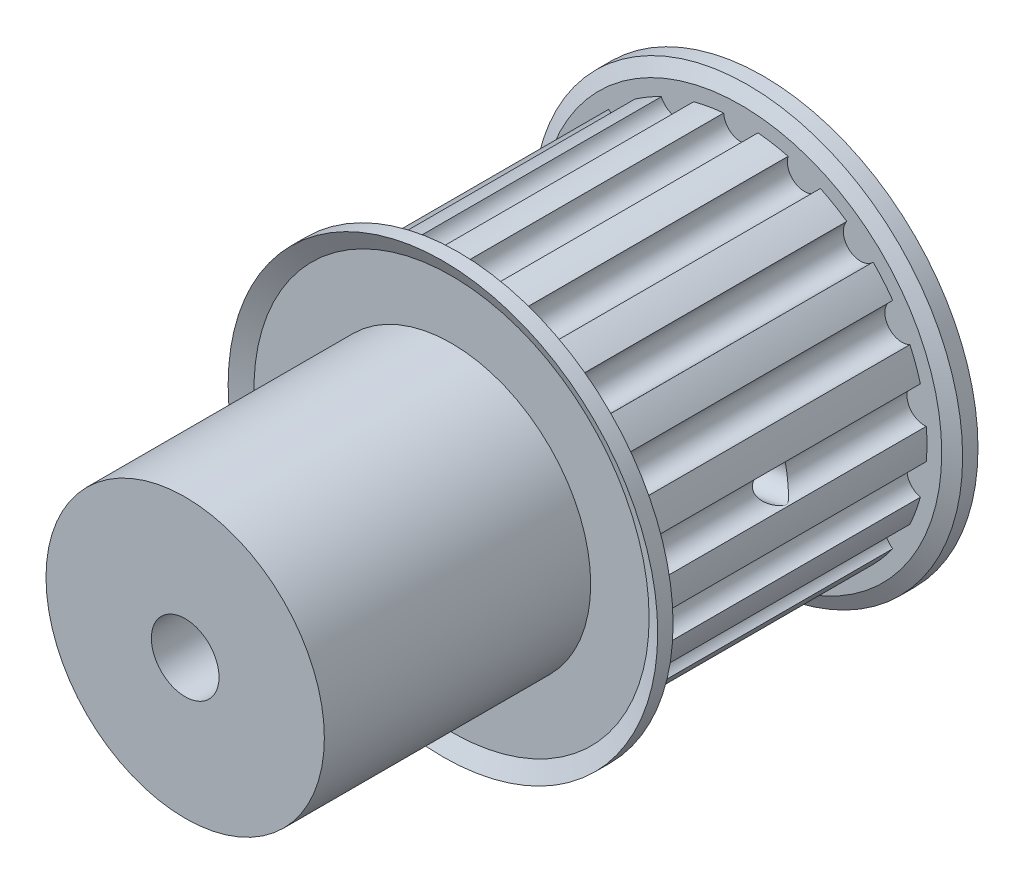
ISO-10303-21;
HEADER;
FILE_DESCRIPTION(('STEP AP214'),'2;1');
FILE_NAME('part.step','',(''),(''),'','','');
FILE_SCHEMA(('AUTOMOTIVE_DESIGN { 1 0 10303 214 1 1 1 1 }'));
ENDSEC;
DATA;
#1=APPLICATION_CONTEXT('core data for automotive mechanical design processes');
#2=APPLICATION_PROTOCOL_DEFINITION('international standard','automotive_design',2000,#1);
#3=PRODUCT_CONTEXT('',#1,'mechanical');
#4=PRODUCT('Part','Part','',(#3));
#5=PRODUCT_RELATED_PRODUCT_CATEGORY('part','',(#4));
#6=PRODUCT_DEFINITION_FORMATION('','',#4);
#7=PRODUCT_DEFINITION_CONTEXT('part definition',#1,'design');
#8=PRODUCT_DEFINITION('design','',#6,#7);
#9=PRODUCT_DEFINITION_SHAPE('','',#8);
#10=(LENGTH_UNIT() NAMED_UNIT(*) SI_UNIT(.MILLI.,.METRE.));
#11=(NAMED_UNIT(*) PLANE_ANGLE_UNIT() SI_UNIT($,.RADIAN.));
#12=(NAMED_UNIT(*) SI_UNIT($,.STERADIAN.) SOLID_ANGLE_UNIT());
#13=UNCERTAINTY_MEASURE_WITH_UNIT(LENGTH_MEASURE(1.E-05),#10,'distance_accuracy_value','');
#14=(GEOMETRIC_REPRESENTATION_CONTEXT(3) GLOBAL_UNCERTAINTY_ASSIGNED_CONTEXT((#13)) GLOBAL_UNIT_ASSIGNED_CONTEXT((#10,
#11,#12)) REPRESENTATION_CONTEXT('',''));
#15=CARTESIAN_POINT('',(0.,0.,0.));
#16=DIRECTION('',(0.,0.,1.));
#17=DIRECTION('',(1.,0.,0.));
#18=AXIS2_PLACEMENT_3D('',#15,#16,#17);
#19=CARTESIAN_POINT('',(0.,0.,32.0215487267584));
#20=DIRECTION('',(0.,0.,1.));
#21=DIRECTION('',(1.,0.,0.));
#22=AXIS2_PLACEMENT_3D('',#19,#20,#21);
#23=CYLINDRICAL_SURFACE('',#22,13.7541);
#24=CARTESIAN_POINT('',(0.,0.,10.1854));
#25=DIRECTION('',(0.,0.,1.));
#26=DIRECTION('',(1.,0.,0.));
#27=AXIS2_PLACEMENT_3D('',#24,#25,#26);
#28=CIRCLE('',#27,13.7541);
#29=CARTESIAN_POINT('',(7.83143717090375,11.3068058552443,10.1854));
#30=VERTEX_POINT('',#29);
#31=CARTESIAN_POINT('',(5.87626252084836,12.4356264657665,10.1854));
#32=VERTEX_POINT('',#31);
#33=EDGE_CURVE('E308',#30,#32,#28,.T.);
#34=ORIENTED_EDGE('',*,*,#33,.F.);
#35=DIRECTION('',(0.,0.,1.));
#36=VECTOR('',#35,1.);
#37=CARTESIAN_POINT('',(7.83143717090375,11.3068058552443,-13.1890875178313));
#38=LINE('',#37,#36);
#39=CARTESIAN_POINT('',(7.83143717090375,11.3068058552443,-10.1854));
#40=VERTEX_POINT('',#39);
#41=EDGE_CURVE('E289',#40,#30,#38,.T.);
#42=ORIENTED_EDGE('',*,*,#41,.F.);
#43=CARTESIAN_POINT('',(0.,0.,-10.1854));
#44=DIRECTION('',(0.,0.,1.));
#45=DIRECTION('',(1.,0.,0.));
#46=AXIS2_PLACEMENT_3D('',#43,#44,#45);
#47=CIRCLE('',#46,13.7541);
#48=CARTESIAN_POINT('',(5.87626252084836,12.4356264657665,-10.1854));
#49=VERTEX_POINT('',#48);
#50=EDGE_CURVE('E462',#40,#49,#47,.T.);
#51=ORIENTED_EDGE('',*,*,#50,.T.);
#52=DIRECTION('',(0.,0.,1.));
#53=VECTOR('',#52,1.);
#54=CARTESIAN_POINT('',(5.87626252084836,12.4356264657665,-13.1319791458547));
#55=LINE('',#54,#53);
#56=EDGE_CURVE('E657',#49,#32,#55,.T.);
#57=ORIENTED_EDGE('',*,*,#56,.T.);
#58=EDGE_LOOP('',(#34,#42,#51,#57));
#59=FACE_BOUND('',#58,.T.);
#60=ADVANCED_FACE('F38',(#59),#23,.T.);
#61=CARTESIAN_POINT('',(11.2262990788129,7.9464127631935,-10.1854));
#62=VERTEX_POINT('',#61);
#63=CARTESIAN_POINT('',(9.77511527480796,9.67586627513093,-10.1854));
#64=VERTEX_POINT('',#63);
#65=EDGE_CURVE('E300',#62,#64,#47,.T.);
#66=ORIENTED_EDGE('',*,*,#65,.T.);
#67=DIRECTION('',(0.,0.,1.));
#68=VECTOR('',#67,1.);
#69=CARTESIAN_POINT('',(9.77511527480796,9.67586627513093,-13.1890875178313));
#70=LINE('',#69,#68);
#71=CARTESIAN_POINT('',(9.77511527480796,9.67586627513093,10.1854));
#72=VERTEX_POINT('',#71);
#73=EDGE_CURVE('E286',#64,#72,#70,.T.);
#74=ORIENTED_EDGE('',*,*,#73,.T.);
#75=CARTESIAN_POINT('',(11.2262990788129,7.9464127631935,10.1854));
#76=VERTEX_POINT('',#75);
#77=EDGE_CURVE('E299',#76,#72,#28,.T.);
#78=ORIENTED_EDGE('',*,*,#77,.F.);
#79=DIRECTION('',(0.,0.,1.));
#80=VECTOR('',#79,1.);
#81=CARTESIAN_POINT('',(11.2262990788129,7.9464127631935,-13.170068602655));
#82=LINE('',#81,#80);
#83=EDGE_CURVE('E293',#62,#76,#82,.T.);
#84=ORIENTED_EDGE('',*,*,#83,.F.);
#85=EDGE_LOOP('',(#66,#74,#78,#84));
#86=FACE_BOUND('',#85,.T.);
#87=ADVANCED_FACE('F297',(#86),#23,.T.);
#88=CARTESIAN_POINT('',(13.2671036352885,3.62756501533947,-10.1854));
#89=VERTEX_POINT('',#88);
#90=CARTESIAN_POINT('',(12.4949448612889,5.74905381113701,-10.1854));
#91=VERTEX_POINT('',#90);
#92=EDGE_CURVE('E748',#89,#91,#47,.T.);
#93=ORIENTED_EDGE('',*,*,#92,.T.);
#94=DIRECTION('',(0.,0.,1.));
#95=VECTOR('',#94,1.);
#96=CARTESIAN_POINT('',(12.4949448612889,5.74905381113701,-13.170068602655));
#97=LINE('',#96,#95);
#98=CARTESIAN_POINT('',(12.4949448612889,5.74905381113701,10.1854));
#99=VERTEX_POINT('',#98);
#100=EDGE_CURVE('E753',#91,#99,#97,.T.);
#101=ORIENTED_EDGE('',*,*,#100,.T.);
#102=CARTESIAN_POINT('',(13.2671036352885,3.62756501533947,10.1854));
#103=VERTEX_POINT('',#102);
#104=EDGE_CURVE('E307',#103,#99,#28,.T.);
#105=ORIENTED_EDGE('',*,*,#104,.F.);
#106=DIRECTION('',(0.,0.,1.));
#107=VECTOR('',#106,1.);
#108=CARTESIAN_POINT('',(13.2671036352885,3.62756501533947,-13.0747342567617));
#109=LINE('',#108,#107);
#110=EDGE_CURVE('E528',#89,#103,#109,.T.);
#111=ORIENTED_EDGE('',*,*,#110,.F.);
#112=EDGE_LOOP('',(#93,#101,#105,#111));
#113=FACE_BOUND('',#112,.T.);
#114=ADVANCED_FACE('F425',(#113),#23,.T.);
#115=CARTESIAN_POINT('',(13.7076996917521,-1.12882061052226,-10.1854));
#116=VERTEX_POINT('',#115);
#117=CARTESIAN_POINT('',(13.7076996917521,1.12882061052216,-10.1854));
#118=VERTEX_POINT('',#117);
#119=EDGE_CURVE('E527',#116,#118,#47,.T.);
#120=ORIENTED_EDGE('',*,*,#119,.T.);
#121=DIRECTION('',(0.,0.,1.));
#122=VECTOR('',#121,1.);
#123=CARTESIAN_POINT('',(13.7076996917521,1.12882061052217,-13.0747342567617));
#124=LINE('',#123,#122);
#125=CARTESIAN_POINT('',(13.7076996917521,1.12882061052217,10.1854));
#126=VERTEX_POINT('',#125);
#127=EDGE_CURVE('E526',#118,#126,#124,.T.);
#128=ORIENTED_EDGE('',*,*,#127,.T.);
#129=CARTESIAN_POINT('',(13.7076996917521,-1.12882061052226,10.1854));
#130=VERTEX_POINT('',#129);
#131=EDGE_CURVE('E310',#130,#126,#28,.T.);
#132=ORIENTED_EDGE('',*,*,#131,.F.);
#133=DIRECTION('',(0.,0.,1.));
#134=VECTOR('',#133,1.);
#135=CARTESIAN_POINT('',(13.7076996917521,-1.12882061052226,-13.0747342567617));
#136=LINE('',#135,#134);
#137=EDGE_CURVE('E523',#116,#130,#136,.T.);
#138=ORIENTED_EDGE('',*,*,#137,.F.);
#139=EDGE_LOOP('',(#120,#128,#132,#138));
#140=FACE_BOUND('',#139,.T.);
#141=ADVANCED_FACE('F522',(#140),#23,.T.);
#142=CARTESIAN_POINT('',(12.4949448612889,-5.74905381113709,-10.1854));
#143=VERTEX_POINT('',#142);
#144=CARTESIAN_POINT('',(13.2671036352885,-3.62756501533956,-10.1854));
#145=VERTEX_POINT('',#144);
#146=EDGE_CURVE('E740',#143,#145,#47,.T.);
#147=ORIENTED_EDGE('',*,*,#146,.T.);
#148=DIRECTION('',(0.,0.,1.));
#149=VECTOR('',#148,1.);
#150=CARTESIAN_POINT('',(13.2671036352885,-3.62756501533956,-13.0747342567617));
#151=LINE('',#150,#149);
#152=CARTESIAN_POINT('',(13.2671036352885,-3.62756501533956,10.1854));
#153=VERTEX_POINT('',#152);
#154=EDGE_CURVE('E539',#145,#153,#151,.T.);
#155=ORIENTED_EDGE('',*,*,#154,.T.);
#156=CARTESIAN_POINT('',(12.4949448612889,-5.7490538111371,10.1854));
#157=VERTEX_POINT('',#156);
#158=EDGE_CURVE('E506',#157,#153,#28,.T.);
#159=ORIENTED_EDGE('',*,*,#158,.F.);
#160=DIRECTION('',(0.,0.,1.));
#161=VECTOR('',#160,1.);
#162=CARTESIAN_POINT('',(12.4949448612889,-5.7490538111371,-13.170068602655));
#163=LINE('',#162,#161);
#164=EDGE_CURVE('E537',#143,#157,#163,.T.);
#165=ORIENTED_EDGE('',*,*,#164,.F.);
#166=EDGE_LOOP('',(#147,#155,#159,#165));
#167=FACE_BOUND('',#166,.T.);
#168=ADVANCED_FACE('F1187',(#167),#23,.T.);
#169=CARTESIAN_POINT('',(9.7751152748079,-9.675866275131,-10.1854));
#170=VERTEX_POINT('',#169);
#171=CARTESIAN_POINT('',(11.2262990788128,-7.94641276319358,-10.1854));
#172=VERTEX_POINT('',#171);
#173=EDGE_CURVE('E735',#170,#172,#47,.T.);
#174=ORIENTED_EDGE('',*,*,#173,.T.);
#175=DIRECTION('',(0.,0.,1.));
#176=VECTOR('',#175,1.);
#177=CARTESIAN_POINT('',(11.2262990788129,-7.94641276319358,-13.170068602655));
#178=LINE('',#177,#176);
#179=CARTESIAN_POINT('',(11.2262990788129,-7.94641276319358,10.1854));
#180=VERTEX_POINT('',#179);
#181=EDGE_CURVE('E548',#172,#180,#178,.T.);
#182=ORIENTED_EDGE('',*,*,#181,.T.);
#183=CARTESIAN_POINT('',(9.7751152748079,-9.675866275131,10.1854));
#184=VERTEX_POINT('',#183);
#185=EDGE_CURVE('E502',#184,#180,#28,.T.);
#186=ORIENTED_EDGE('',*,*,#185,.F.);
#187=DIRECTION('',(0.,0.,1.));
#188=VECTOR('',#187,1.);
#189=CARTESIAN_POINT('',(9.7751152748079,-9.675866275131,-13.1890875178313));
#190=LINE('',#189,#188);
#191=EDGE_CURVE('E546',#170,#184,#190,.T.);
#192=ORIENTED_EDGE('',*,*,#191,.F.);
#193=EDGE_LOOP('',(#174,#182,#186,#192));
#194=FACE_BOUND('',#193,.T.);
#195=ADVANCED_FACE('F1179',(#194),#23,.T.);
#196=CARTESIAN_POINT('',(5.87626252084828,-12.4356264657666,-10.1854));
#197=VERTEX_POINT('',#196);
#198=CARTESIAN_POINT('',(7.83143717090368,-11.3068058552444,-10.1854));
#199=VERTEX_POINT('',#198);
#200=EDGE_CURVE('E730',#197,#199,#47,.T.);
#201=ORIENTED_EDGE('',*,*,#200,.T.);
#202=DIRECTION('',(0.,0.,1.));
#203=VECTOR('',#202,1.);
#204=CARTESIAN_POINT('',(7.83143717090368,-11.3068058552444,-13.1890875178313));
#205=LINE('',#204,#203);
#206=CARTESIAN_POINT('',(7.83143717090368,-11.3068058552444,10.1854));
#207=VERTEX_POINT('',#206);
#208=EDGE_CURVE('E557',#199,#207,#205,.T.);
#209=ORIENTED_EDGE('',*,*,#208,.T.);
#210=CARTESIAN_POINT('',(5.87626252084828,-12.4356264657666,10.1854));
#211=VERTEX_POINT('',#210);
#212=EDGE_CURVE('E498',#211,#207,#28,.T.);
#213=ORIENTED_EDGE('',*,*,#212,.F.);
#214=DIRECTION('',(0.,0.,1.));
#215=VECTOR('',#214,1.);
#216=CARTESIAN_POINT('',(5.87626252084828,-12.4356264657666,-13.1319791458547));
#217=LINE('',#216,#215);
#218=EDGE_CURVE('E555',#197,#211,#217,.T.);
#219=ORIENTED_EDGE('',*,*,#218,.F.);
#220=EDGE_LOOP('',(#201,#209,#213,#219));
#221=FACE_BOUND('',#220,.T.);
#222=ADVANCED_FACE('F1171',(#221),#23,.T.);
#223=CARTESIAN_POINT('',(1.26864578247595,-13.6954665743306,-10.1854));
#224=VERTEX_POINT('',#223);
#225=CARTESIAN_POINT('',(3.49198836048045,-13.3034312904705,-10.1854));
#226=VERTEX_POINT('',#225);
#227=EDGE_CURVE('E725',#224,#226,#47,.T.);
#228=ORIENTED_EDGE('',*,*,#227,.T.);
#229=DIRECTION('',(0.,0.,1.));
#230=VECTOR('',#229,1.);
#231=CARTESIAN_POINT('',(3.49198836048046,-13.3034312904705,-13.1319791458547));
#232=LINE('',#231,#230);
#233=CARTESIAN_POINT('',(3.49198836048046,-13.3034312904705,10.1854));
#234=VERTEX_POINT('',#233);
#235=EDGE_CURVE('E566',#226,#234,#232,.T.);
#236=ORIENTED_EDGE('',*,*,#235,.T.);
#237=CARTESIAN_POINT('',(1.26864578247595,-13.6954665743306,10.1854));
#238=VERTEX_POINT('',#237);
#239=EDGE_CURVE('E494',#238,#234,#28,.T.);
#240=ORIENTED_EDGE('',*,*,#239,.F.);
#241=DIRECTION('',(0.,0.,1.));
#242=VECTOR('',#241,1.);
#243=CARTESIAN_POINT('',(1.26864578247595,-13.6954665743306,-13.0227840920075));
#244=LINE('',#243,#242);
#245=EDGE_CURVE('E564',#224,#238,#244,.T.);
#246=ORIENTED_EDGE('',*,*,#245,.F.);
#247=EDGE_LOOP('',(#228,#236,#240,#246));
#248=FACE_BOUND('',#247,.T.);
#249=ADVANCED_FACE('F1163',(#248),#23,.T.);
#250=CARTESIAN_POINT('',(-3.49198836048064,-13.3034312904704,-10.1854));
#251=VERTEX_POINT('',#250);
#252=CARTESIAN_POINT('',(-1.26864578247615,-13.6954665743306,-10.1854));
#253=VERTEX_POINT('',#252);
#254=EDGE_CURVE('E720',#251,#253,#47,.T.);
#255=ORIENTED_EDGE('',*,*,#254,.T.);
#256=DIRECTION('',(0.,0.,1.));
#257=VECTOR('',#256,1.);
#258=CARTESIAN_POINT('',(-1.26864578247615,-13.6954665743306,-13.0227840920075));
#259=LINE('',#258,#257);
#260=CARTESIAN_POINT('',(-1.26864578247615,-13.6954665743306,10.1854));
#261=VERTEX_POINT('',#260);
#262=EDGE_CURVE('E575',#253,#261,#259,.T.);
#263=ORIENTED_EDGE('',*,*,#262,.T.);
#264=CARTESIAN_POINT('',(-3.49198836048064,-13.3034312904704,10.1854));
#265=VERTEX_POINT('',#264);
#266=EDGE_CURVE('E490',#265,#261,#28,.T.);
#267=ORIENTED_EDGE('',*,*,#266,.F.);
#268=DIRECTION('',(0.,0.,1.));
#269=VECTOR('',#268,1.);
#270=CARTESIAN_POINT('',(-3.49198836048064,-13.3034312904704,-13.1319791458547));
#271=LINE('',#270,#269);
#272=EDGE_CURVE('E573',#251,#265,#271,.T.);
#273=ORIENTED_EDGE('',*,*,#272,.F.);
#274=EDGE_LOOP('',(#255,#263,#267,#273));
#275=FACE_BOUND('',#274,.T.);
#276=ADVANCED_FACE('F1155',(#275),#23,.T.);
#277=CARTESIAN_POINT('',(-7.83143717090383,-11.3068058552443,-10.1854));
#278=VERTEX_POINT('',#277);
#279=CARTESIAN_POINT('',(-5.87626252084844,-12.4356264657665,-10.1854));
#280=VERTEX_POINT('',#279);
#281=EDGE_CURVE('E715',#278,#280,#47,.T.);
#282=ORIENTED_EDGE('',*,*,#281,.T.);
#283=DIRECTION('',(0.,0.,1.));
#284=VECTOR('',#283,1.);
#285=CARTESIAN_POINT('',(-5.87626252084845,-12.4356264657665,-13.1319791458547));
#286=LINE('',#285,#284);
#287=CARTESIAN_POINT('',(-5.87626252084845,-12.4356264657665,10.1854));
#288=VERTEX_POINT('',#287);
#289=EDGE_CURVE('E584',#280,#288,#286,.T.);
#290=ORIENTED_EDGE('',*,*,#289,.T.);
#291=CARTESIAN_POINT('',(-7.83143717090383,-11.3068058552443,10.1854));
#292=VERTEX_POINT('',#291);
#293=EDGE_CURVE('E486',#292,#288,#28,.T.);
#294=ORIENTED_EDGE('',*,*,#293,.F.);
#295=DIRECTION('',(0.,0.,1.));
#296=VECTOR('',#295,1.);
#297=CARTESIAN_POINT('',(-7.83143717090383,-11.3068058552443,-13.1890875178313));
#298=LINE('',#297,#296);
#299=EDGE_CURVE('E582',#278,#292,#298,.T.);
#300=ORIENTED_EDGE('',*,*,#299,.F.);
#301=EDGE_LOOP('',(#282,#290,#294,#300));
#302=FACE_BOUND('',#301,.T.);
#303=ADVANCED_FACE('F1147',(#302),#23,.T.);
#304=CARTESIAN_POINT('',(-11.226299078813,-7.94641276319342,-10.1854));
#305=VERTEX_POINT('',#304);
#306=CARTESIAN_POINT('',(-9.77511527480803,-9.67586627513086,-10.1854));
#307=VERTEX_POINT('',#306);
#308=EDGE_CURVE('E710',#305,#307,#47,.T.);
#309=ORIENTED_EDGE('',*,*,#308,.T.);
#310=DIRECTION('',(0.,0.,1.));
#311=VECTOR('',#310,1.);
#312=CARTESIAN_POINT('',(-9.77511527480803,-9.67586627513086,-13.1890875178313));
#313=LINE('',#312,#311);
#314=CARTESIAN_POINT('',(-9.77511527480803,-9.67586627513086,10.1854));
#315=VERTEX_POINT('',#314);
#316=EDGE_CURVE('E593',#307,#315,#313,.T.);
#317=ORIENTED_EDGE('',*,*,#316,.T.);
#318=CARTESIAN_POINT('',(-11.226299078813,-7.94641276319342,10.1854));
#319=VERTEX_POINT('',#318);
#320=EDGE_CURVE('E482',#319,#315,#28,.T.);
#321=ORIENTED_EDGE('',*,*,#320,.F.);
#322=DIRECTION('',(0.,0.,1.));
#323=VECTOR('',#322,1.);
#324=CARTESIAN_POINT('',(-11.226299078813,-7.94641276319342,-13.170068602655));
#325=LINE('',#324,#323);
#326=EDGE_CURVE('E591',#305,#319,#325,.T.);
#327=ORIENTED_EDGE('',*,*,#326,.F.);
#328=EDGE_LOOP('',(#309,#317,#321,#327));
#329=FACE_BOUND('',#328,.T.);
#330=ADVANCED_FACE('F1139',(#329),#23,.T.);
#331=CARTESIAN_POINT('',(-13.2671036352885,-3.62756501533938,-10.1854));
#332=VERTEX_POINT('',#331);
#333=CARTESIAN_POINT('',(-12.494944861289,-5.74905381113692,-10.1854));
#334=VERTEX_POINT('',#333);
#335=EDGE_CURVE('E705',#332,#334,#47,.T.);
#336=ORIENTED_EDGE('',*,*,#335,.T.);
#337=DIRECTION('',(0.,0.,1.));
#338=VECTOR('',#337,1.);
#339=CARTESIAN_POINT('',(-12.494944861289,-5.74905381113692,-13.170068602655));
#340=LINE('',#339,#338);
#341=CARTESIAN_POINT('',(-12.494944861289,-5.74905381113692,10.1854));
#342=VERTEX_POINT('',#341);
#343=EDGE_CURVE('E602',#334,#342,#340,.T.);
#344=ORIENTED_EDGE('',*,*,#343,.T.);
#345=CARTESIAN_POINT('',(-13.2671036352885,-3.62756501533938,10.1854));
#346=VERTEX_POINT('',#345);
#347=EDGE_CURVE('E478',#346,#342,#28,.T.);
#348=ORIENTED_EDGE('',*,*,#347,.F.);
#349=DIRECTION('',(0.,0.,1.));
#350=VECTOR('',#349,1.);
#351=CARTESIAN_POINT('',(-13.2671036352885,-3.62756501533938,-13.0747342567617));
#352=LINE('',#351,#350);
#353=EDGE_CURVE('E600',#332,#346,#352,.T.);
#354=ORIENTED_EDGE('',*,*,#353,.F.);
#355=EDGE_LOOP('',(#336,#344,#348,#354));
#356=FACE_BOUND('',#355,.T.);
#357=ADVANCED_FACE('F1131',(#356),#23,.T.);
#358=CARTESIAN_POINT('',(-13.7076996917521,1.12882061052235,-10.1854));
#359=VERTEX_POINT('',#358);
#360=CARTESIAN_POINT('',(-13.7076996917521,-1.12882061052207,-10.1854));
#361=VERTEX_POINT('',#360);
#362=EDGE_CURVE('E700',#359,#361,#47,.T.);
#363=ORIENTED_EDGE('',*,*,#362,.T.);
#364=DIRECTION('',(0.,0.,1.));
#365=VECTOR('',#364,1.);
#366=CARTESIAN_POINT('',(-13.7076996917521,-1.12882061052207,-13.0747342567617));
#367=LINE('',#366,#365);
#368=CARTESIAN_POINT('',(-13.7076996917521,-1.12882061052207,10.1854));
#369=VERTEX_POINT('',#368);
#370=EDGE_CURVE('E611',#361,#369,#367,.T.);
#371=ORIENTED_EDGE('',*,*,#370,.T.);
#372=CARTESIAN_POINT('',(-13.7076996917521,1.12882061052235,10.1854));
#373=VERTEX_POINT('',#372);
#374=EDGE_CURVE('E474',#373,#369,#28,.T.);
#375=ORIENTED_EDGE('',*,*,#374,.F.);
#376=DIRECTION('',(0.,0.,1.));
#377=VECTOR('',#376,1.);
#378=CARTESIAN_POINT('',(-13.7076996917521,1.12882061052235,-13.0747342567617));
#379=LINE('',#378,#377);
#380=EDGE_CURVE('E609',#359,#373,#379,.T.);
#381=ORIENTED_EDGE('',*,*,#380,.F.);
#382=EDGE_LOOP('',(#363,#371,#375,#381));
#383=FACE_BOUND('',#382,.T.);
#384=ADVANCED_FACE('F1123',(#383),#23,.T.);
#385=CARTESIAN_POINT('',(-12.4949448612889,5.74905381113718,-10.1854));
#386=VERTEX_POINT('',#385);
#387=CARTESIAN_POINT('',(-13.2671036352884,3.62756501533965,-10.1854));
#388=VERTEX_POINT('',#387);
#389=EDGE_CURVE('E695',#386,#388,#47,.T.);
#390=ORIENTED_EDGE('',*,*,#389,.T.);
#391=DIRECTION('',(0.,0.,1.));
#392=VECTOR('',#391,1.);
#393=CARTESIAN_POINT('',(-13.2671036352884,3.62756501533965,-13.0747342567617));
#394=LINE('',#393,#392);
#395=CARTESIAN_POINT('',(-13.2671036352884,3.62756501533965,10.1854));
#396=VERTEX_POINT('',#395);
#397=EDGE_CURVE('E620',#388,#396,#394,.T.);
#398=ORIENTED_EDGE('',*,*,#397,.T.);
#399=CARTESIAN_POINT('',(-12.4949448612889,5.74905381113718,10.1854));
#400=VERTEX_POINT('',#399);
#401=EDGE_CURVE('E470',#400,#396,#28,.T.);
#402=ORIENTED_EDGE('',*,*,#401,.F.);
#403=DIRECTION('',(0.,0.,1.));
#404=VECTOR('',#403,1.);
#405=CARTESIAN_POINT('',(-12.4949448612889,5.74905381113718,-13.170068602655));
#406=LINE('',#405,#404);
#407=EDGE_CURVE('E618',#386,#400,#406,.T.);
#408=ORIENTED_EDGE('',*,*,#407,.F.);
#409=EDGE_LOOP('',(#390,#398,#402,#408));
#410=FACE_BOUND('',#409,.T.);
#411=ADVANCED_FACE('F1115',(#410),#23,.T.);
#412=CARTESIAN_POINT('',(-9.77511527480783,9.67586627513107,-10.1854));
#413=VERTEX_POINT('',#412);
#414=CARTESIAN_POINT('',(-11.2262990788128,7.94641276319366,-10.1854));
#415=VERTEX_POINT('',#414);
#416=EDGE_CURVE('E691',#413,#415,#47,.T.);
#417=ORIENTED_EDGE('',*,*,#416,.T.);
#418=DIRECTION('',(0.,0.,1.));
#419=VECTOR('',#418,1.);
#420=CARTESIAN_POINT('',(-11.2262990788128,7.94641276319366,-13.170068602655));
#421=LINE('',#420,#419);
#422=CARTESIAN_POINT('',(-11.2262990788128,7.94641276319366,10.1854));
#423=VERTEX_POINT('',#422);
#424=EDGE_CURVE('E629',#415,#423,#421,.T.);
#425=ORIENTED_EDGE('',*,*,#424,.T.);
#426=CARTESIAN_POINT('',(-9.77511527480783,9.67586627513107,10.1854));
#427=VERTEX_POINT('',#426);
#428=EDGE_CURVE('E465',#427,#423,#28,.T.);
#429=ORIENTED_EDGE('',*,*,#428,.F.);
#430=DIRECTION('',(0.,0.,1.));
#431=VECTOR('',#430,1.);
#432=CARTESIAN_POINT('',(-9.77511527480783,9.67586627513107,-13.1890875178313));
#433=LINE('',#432,#431);
#434=EDGE_CURVE('E627',#413,#427,#433,.T.);
#435=ORIENTED_EDGE('',*,*,#434,.F.);
#436=EDGE_LOOP('',(#417,#425,#429,#435));
#437=FACE_BOUND('',#436,.T.);
#438=ADVANCED_FACE('F449',(#437),#23,.T.);
#439=CARTESIAN_POINT('',(-5.8762625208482,12.4356264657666,-10.1854));
#440=VERTEX_POINT('',#439);
#441=CARTESIAN_POINT('',(-7.8314371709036,11.3068058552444,-10.1854));
#442=VERTEX_POINT('',#441);
#443=EDGE_CURVE('E461',#440,#442,#47,.T.);
#444=ORIENTED_EDGE('',*,*,#443,.T.);
#445=DIRECTION('',(0.,0.,1.));
#446=VECTOR('',#445,1.);
#447=CARTESIAN_POINT('',(-7.8314371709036,11.3068058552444,-13.1890875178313));
#448=LINE('',#447,#446);
#449=CARTESIAN_POINT('',(-7.8314371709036,11.3068058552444,10.1854));
#450=VERTEX_POINT('',#449);
#451=EDGE_CURVE('E638',#442,#450,#448,.T.);
#452=ORIENTED_EDGE('',*,*,#451,.T.);
#453=CARTESIAN_POINT('',(-5.8762625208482,12.4356264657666,10.1854));
#454=VERTEX_POINT('',#453);
#455=EDGE_CURVE('E316',#454,#450,#28,.T.);
#456=ORIENTED_EDGE('',*,*,#455,.F.);
#457=DIRECTION('',(0.,0.,1.));
#458=VECTOR('',#457,1.);
#459=CARTESIAN_POINT('',(-5.8762625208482,12.4356264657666,-13.1319791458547));
#460=LINE('',#459,#458);
#461=EDGE_CURVE('E636',#440,#454,#460,.T.);
#462=ORIENTED_EDGE('',*,*,#461,.F.);
#463=EDGE_LOOP('',(#444,#452,#456,#462));
#464=FACE_BOUND('',#463,.T.);
#465=ADVANCED_FACE('F441',(#464),#23,.T.);
#466=CARTESIAN_POINT('',(3.49198836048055,13.3034312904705,10.1854));
#467=VERTEX_POINT('',#466);
#468=CARTESIAN_POINT('',(1.26864578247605,13.6954665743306,10.1854));
#469=VERTEX_POINT('',#468);
#470=EDGE_CURVE('E311',#467,#469,#28,.T.);
#471=ORIENTED_EDGE('',*,*,#470,.F.);
#472=DIRECTION('',(0.,0.,1.));
#473=VECTOR('',#472,1.);
#474=CARTESIAN_POINT('',(3.49198836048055,13.3034312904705,-13.1319791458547));
#475=LINE('',#474,#473);
#476=CARTESIAN_POINT('',(3.49198836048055,13.3034312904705,-10.1854));
#477=VERTEX_POINT('',#476);
#478=EDGE_CURVE('E454',#477,#467,#475,.T.);
#479=ORIENTED_EDGE('',*,*,#478,.F.);
#480=CARTESIAN_POINT('',(1.26864578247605,13.6954665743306,-10.1854));
#481=VERTEX_POINT('',#480);
#482=EDGE_CURVE('E463',#477,#481,#47,.T.);
#483=ORIENTED_EDGE('',*,*,#482,.T.);
#484=DIRECTION('',(0.,0.,1.));
#485=VECTOR('',#484,1.);
#486=CARTESIAN_POINT('',(1.26864578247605,13.6954665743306,-13.0227840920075));
#487=LINE('',#486,#485);
#488=EDGE_CURVE('E457',#481,#469,#487,.T.);
#489=ORIENTED_EDGE('',*,*,#488,.T.);
#490=EDGE_LOOP('',(#471,#479,#483,#489));
#491=FACE_BOUND('',#490,.T.);
#492=ADVANCED_FACE('F431',(#491),#23,.T.);
#493=CARTESIAN_POINT('',(0.,0.,32.0215487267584));
#494=DIRECTION('',(0.,0.,1.));
#495=DIRECTION('',(1.,0.,0.));
#496=AXIS2_PLACEMENT_3D('',#493,#494,#495);
#497=CYLINDRICAL_SURFACE('',#496,10.287);
#498=CARTESIAN_POINT('',(0.,0.,-11.2014));
#499=DIRECTION('',(0.,0.,1.));
#500=DIRECTION('',(1.,0.,0.));
#501=AXIS2_PLACEMENT_3D('',#498,#499,#500);
#502=CIRCLE('',#501,10.287);
#503=CARTESIAN_POINT('',(10.287,0.,-11.2014));
#504=VERTEX_POINT('',#503);
#505=EDGE_CURVE('E675',#504,#504,#502,.T.);
#506=ORIENTED_EDGE('',*,*,#505,.F.);
#507=EDGE_LOOP('',(#506));
#508=FACE_BOUND('',#507,.T.);
#509=CARTESIAN_POINT('',(0.,0.,-11.8364));
#510=DIRECTION('',(0.,0.,1.));
#511=DIRECTION('',(1.,0.,0.));
#512=AXIS2_PLACEMENT_3D('',#509,#510,#511);
#513=CIRCLE('',#512,10.287);
#514=CARTESIAN_POINT('',(10.287,0.,-11.8364));
#515=VERTEX_POINT('',#514);
#516=EDGE_CURVE('E11',#515,#515,#513,.T.);
#517=ORIENTED_EDGE('',*,*,#516,.T.);
#518=EDGE_LOOP('',(#517));
#519=FACE_BOUND('',#518,.T.);
#520=ADVANCED_FACE('F40',(#508,#519),#497,.T.);
#521=CARTESIAN_POINT('',(0.,10.287,-11.8364));
#522=DIRECTION('',(0.,0.,1.));
#523=DIRECTION('',(1.,0.,0.));
#524=AXIS2_PLACEMENT_3D('',#521,#522,#523);
#525=PLANE('',#524);
#526=CARTESIAN_POINT('',(0.,0.,-11.8364));
#527=DIRECTION('',(0.,0.,1.));
#528=DIRECTION('',(1.,0.,0.));
#529=AXIS2_PLACEMENT_3D('',#526,#527,#528);
#530=CIRCLE('',#529,2.5);
#531=CARTESIAN_POINT('',(2.5,0.,-11.8364));
#532=VERTEX_POINT('',#531);
#533=EDGE_CURVE('E645',#532,#532,#530,.T.);
#534=ORIENTED_EDGE('',*,*,#533,.T.);
#535=EDGE_LOOP('',(#534));
#536=FACE_BOUND('',#535,.T.);
#537=ORIENTED_EDGE('',*,*,#516,.F.);
#538=EDGE_LOOP('',(#537));
#539=FACE_BOUND('',#538,.T.);
#540=ADVANCED_FACE('F447',(#536,#539),#525,.F.);
#541=CARTESIAN_POINT('',(0.,0.,30.8864));
#542=DIRECTION('',(0.,0.,-1.));
#543=DIRECTION('',(-1.,0.,0.));
#544=AXIS2_PLACEMENT_3D('',#541,#542,#543);
#545=PLANE('',#544);
#546=CARTESIAN_POINT('',(0.,0.,30.8864));
#547=DIRECTION('',(0.,0.,1.));
#548=DIRECTION('',(1.,0.,0.));
#549=AXIS2_PLACEMENT_3D('',#546,#547,#548);
#550=CIRCLE('',#549,2.5);
#551=CARTESIAN_POINT('',(2.5,0.,30.8864));
#552=VERTEX_POINT('',#551);
#553=EDGE_CURVE('E763',#552,#552,#550,.T.);
#554=ORIENTED_EDGE('',*,*,#553,.F.);
#555=EDGE_LOOP('',(#554));
#556=FACE_BOUND('',#555,.T.);
#557=CARTESIAN_POINT('',(0.,0.,30.8864));
#558=DIRECTION('',(0.,0.,1.));
#559=DIRECTION('',(1.,0.,0.));
#560=AXIS2_PLACEMENT_3D('',#557,#558,#559);
#561=CIRCLE('',#560,10.287);
#562=CARTESIAN_POINT('',(10.287,0.,30.8864));
#563=VERTEX_POINT('',#562);
#564=EDGE_CURVE('E52',#563,#563,#561,.T.);
#565=ORIENTED_EDGE('',*,*,#564,.T.);
#566=EDGE_LOOP('',(#565));
#567=FACE_BOUND('',#566,.T.);
#568=ADVANCED_FACE('F778',(#556,#567),#545,.F.);
#569=CARTESIAN_POINT('',(0.,0.,32.0215487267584));
#570=DIRECTION('',(0.,0.,1.));
#571=DIRECTION('',(1.,0.,0.));
#572=AXIS2_PLACEMENT_3D('',#569,#570,#571);
#573=CYLINDRICAL_SURFACE('',#572,10.287);
#574=ORIENTED_EDGE('',*,*,#564,.F.);
#575=EDGE_LOOP('',(#574));
#576=FACE_BOUND('',#575,.T.);
#577=CARTESIAN_POINT('',(0.,0.,11.2014));
#578=DIRECTION('',(0.,0.,1.));
#579=DIRECTION('',(1.,0.,0.));
#580=AXIS2_PLACEMENT_3D('',#577,#578,#579);
#581=CIRCLE('',#580,10.287);
#582=CARTESIAN_POINT('',(10.287,0.,11.2014));
#583=VERTEX_POINT('',#582);
#584=EDGE_CURVE('E330',#583,#583,#581,.T.);
#585=ORIENTED_EDGE('',*,*,#584,.T.);
#586=EDGE_LOOP('',(#585));
#587=FACE_BOUND('',#586,.T.);
#588=ADVANCED_FACE('F781',(#576,#587),#573,.T.);
#589=CARTESIAN_POINT('',(0.,10.287,11.2014));
#590=DIRECTION('',(0.,0.,-1.));
#591=DIRECTION('',(-1.,0.,0.));
#592=AXIS2_PLACEMENT_3D('',#589,#590,#591);
#593=PLANE('',#592);
#594=ORIENTED_EDGE('',*,*,#584,.F.);
#595=EDGE_LOOP('',(#594));
#596=FACE_BOUND('',#595,.T.);
#597=CARTESIAN_POINT('',(0.,0.,11.2014));
#598=DIRECTION('',(0.,0.,1.));
#599=DIRECTION('',(1.,0.,0.));
#600=AXIS2_PLACEMENT_3D('',#597,#598,#599);
#601=CIRCLE('',#600,14.605);
#602=CARTESIAN_POINT('',(14.605,0.,11.2014));
#603=VERTEX_POINT('',#602);
#604=EDGE_CURVE('E327',#603,#603,#601,.T.);
#605=ORIENTED_EDGE('',*,*,#604,.T.);
#606=EDGE_LOOP('',(#605));
#607=FACE_BOUND('',#606,.T.);
#608=ADVANCED_FACE('F787',(#596,#607),#593,.F.);
#609=CARTESIAN_POINT('',(0.,0.,11.8364));
#610=DIRECTION('',(0.,0.,1.));
#611=DIRECTION('',(1.,0.,0.));
#612=AXIS2_PLACEMENT_3D('',#609,#610,#611);
#613=CONICAL_SURFACE('',#612,15.875,1.10714871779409);
#614=ORIENTED_EDGE('',*,*,#604,.F.);
#615=EDGE_LOOP('',(#614));
#616=FACE_BOUND('',#615,.T.);
#617=CARTESIAN_POINT('',(0.,0.,11.8364));
#618=DIRECTION('',(0.,0.,1.));
#619=DIRECTION('',(1.,0.,0.));
#620=AXIS2_PLACEMENT_3D('',#617,#618,#619);
#621=CIRCLE('',#620,15.875);
#622=CARTESIAN_POINT('',(15.875,0.,11.8364));
#623=VERTEX_POINT('',#622);
#624=EDGE_CURVE('E324',#623,#623,#621,.T.);
#625=ORIENTED_EDGE('',*,*,#624,.T.);
#626=EDGE_LOOP('',(#625));
#627=FACE_BOUND('',#626,.T.);
#628=ADVANCED_FACE('F793',(#616,#627),#613,.F.);
#629=CARTESIAN_POINT('',(0.,0.,32.0215487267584));
#630=DIRECTION('',(0.,0.,1.));
#631=DIRECTION('',(1.,0.,0.));
#632=AXIS2_PLACEMENT_3D('',#629,#630,#631);
#633=CYLINDRICAL_SURFACE('',#632,15.875);
#634=ORIENTED_EDGE('',*,*,#624,.F.);
#635=EDGE_LOOP('',(#634));
#636=FACE_BOUND('',#635,.T.);
#637=CARTESIAN_POINT('',(0.,0.,10.7004774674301));
#638=DIRECTION('',(0.,0.,1.));
#639=DIRECTION('',(1.,0.,0.));
#640=AXIS2_PLACEMENT_3D('',#637,#638,#639);
#641=CIRCLE('',#640,15.875);
#642=CARTESIAN_POINT('',(15.875,0.,10.7004774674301));
#643=VERTEX_POINT('',#642);
#644=EDGE_CURVE('E321',#643,#643,#641,.T.);
#645=ORIENTED_EDGE('',*,*,#644,.T.);
#646=EDGE_LOOP('',(#645));
#647=FACE_BOUND('',#646,.T.);
#648=ADVANCED_FACE('F799',(#636,#647),#633,.T.);
#649=CARTESIAN_POINT('',(0.,0.,10.1854));
#650=DIRECTION('',(0.,0.,1.));
#651=DIRECTION('',(1.,0.,0.));
#652=AXIS2_PLACEMENT_3D('',#649,#650,#651);
#653=CONICAL_SURFACE('',#652,14.8448450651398,1.10714871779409);
#654=ORIENTED_EDGE('',*,*,#644,.F.);
#655=EDGE_LOOP('',(#654));
#656=FACE_BOUND('',#655,.T.);
#657=CARTESIAN_POINT('',(0.,0.,10.1854));
#658=DIRECTION('',(0.,0.,1.));
#659=DIRECTION('',(1.,0.,0.));
#660=AXIS2_PLACEMENT_3D('',#657,#658,#659);
#661=CIRCLE('',#660,14.8448450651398);
#662=CARTESIAN_POINT('',(14.8448450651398,0.,10.1854));
#663=VERTEX_POINT('',#662);
#664=EDGE_CURVE('E315',#663,#663,#661,.T.);
#665=ORIENTED_EDGE('',*,*,#664,.T.);
#666=EDGE_LOOP('',(#665));
#667=FACE_BOUND('',#666,.T.);
#668=ADVANCED_FACE('F437',(#656,#667),#653,.T.);
#669=CARTESIAN_POINT('',(0.,14.8448450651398,10.1854));
#670=DIRECTION('',(0.,0.,1.));
#671=DIRECTION('',(1.,0.,0.));
#672=AXIS2_PLACEMENT_3D('',#669,#670,#671);
#673=PLANE('',#672);
#674=ORIENTED_EDGE('',*,*,#664,.F.);
#675=EDGE_LOOP('',(#674));
#676=FACE_BOUND('',#675,.T.);
#677=CARTESIAN_POINT('',(-1.26864578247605,13.6954665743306,10.1854));
#678=VERTEX_POINT('',#677);
#679=CARTESIAN_POINT('',(-3.49198836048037,13.3034312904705,10.1854));
#680=VERTEX_POINT('',#679);
#681=EDGE_CURVE('E312',#678,#680,#28,.T.);
#682=ORIENTED_EDGE('',*,*,#681,.T.);
#683=CARTESIAN_POINT('',(-4.70417925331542,12.9246262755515,10.1854));
#684=DIRECTION('',(0.,0.,1.));
#685=DIRECTION('',(0.939692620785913,0.342020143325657,0.));
#686=AXIS2_PLACEMENT_3D('',#683,#684,#685);
#687=CIRCLE('',#686,1.27);
#688=EDGE_CURVE('E642',#454,#680,#687,.T.);
#689=ORIENTED_EDGE('',*,*,#688,.F.);
#690=ORIENTED_EDGE('',*,*,#455,.T.);
#691=CARTESIAN_POINT('',(-8.8409650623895,10.5362518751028,10.1854));
#692=DIRECTION('',(0.,0.,1.));
#693=DIRECTION('',(0.766044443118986,0.64278760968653,0.));
#694=AXIS2_PLACEMENT_3D('',#691,#692,#693);
#695=CIRCLE('',#694,1.27);
#696=EDGE_CURVE('E633',#427,#450,#695,.T.);
#697=ORIENTED_EDGE('',*,*,#696,.F.);
#698=ORIENTED_EDGE('',*,*,#428,.T.);
#699=CARTESIAN_POINT('',(-11.9114000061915,6.87705000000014,10.1854));
#700=DIRECTION('',(0.,0.,1.));
#701=DIRECTION('',(0.50000000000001,0.866025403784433,0.));
#702=AXIS2_PLACEMENT_3D('',#699,#700,#701);
#703=CIRCLE('',#702,1.27);
#704=EDGE_CURVE('E624',#400,#423,#703,.T.);
#705=ORIENTED_EDGE('',*,*,#704,.F.);
#706=ORIENTED_EDGE('',*,*,#401,.T.);
#707=CARTESIAN_POINT('',(-13.5451443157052,2.38837440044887,10.1854));
#708=DIRECTION('',(0.,0.,1.));
#709=DIRECTION('',(0.17364817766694,0.984807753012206,0.));
#710=AXIS2_PLACEMENT_3D('',#707,#708,#709);
#711=CIRCLE('',#710,1.27);
#712=EDGE_CURVE('E615',#373,#396,#711,.T.);
#713=ORIENTED_EDGE('',*,*,#712,.F.);
#714=ORIENTED_EDGE('',*,*,#374,.T.);
#715=CARTESIAN_POINT('',(-13.5451443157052,-2.38837440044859,10.1854));
#716=DIRECTION('',(0.,0.,1.));
#717=DIRECTION('',(-0.173648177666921,0.98480775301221,0.));
#718=AXIS2_PLACEMENT_3D('',#715,#716,#717);
#719=CIRCLE('',#718,1.27);
#720=EDGE_CURVE('E606',#346,#369,#719,.T.);
#721=ORIENTED_EDGE('',*,*,#720,.F.);
#722=ORIENTED_EDGE('',*,*,#347,.T.);
#723=CARTESIAN_POINT('',(-11.9114000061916,-6.87704999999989,10.1854));
#724=DIRECTION('',(0.,0.,1.));
#725=DIRECTION('',(-0.499999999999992,0.866025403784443,0.));
#726=AXIS2_PLACEMENT_3D('',#723,#724,#725);
#727=CIRCLE('',#726,1.27);
#728=EDGE_CURVE('E597',#319,#342,#727,.T.);
#729=ORIENTED_EDGE('',*,*,#728,.F.);
#730=ORIENTED_EDGE('',*,*,#320,.T.);
#731=CARTESIAN_POINT('',(-8.84096506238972,-10.5362518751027,10.1854));
#732=DIRECTION('',(0.,0.,1.));
#733=DIRECTION('',(-0.766044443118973,0.642787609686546,0.));
#734=AXIS2_PLACEMENT_3D('',#731,#732,#733);
#735=CIRCLE('',#734,1.27);
#736=EDGE_CURVE('E588',#292,#315,#735,.T.);
#737=ORIENTED_EDGE('',*,*,#736,.F.);
#738=ORIENTED_EDGE('',*,*,#293,.T.);
#739=CARTESIAN_POINT('',(-4.70417925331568,-12.9246262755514,10.1854));
#740=DIRECTION('',(0.,0.,1.));
#741=DIRECTION('',(-0.939692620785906,0.342020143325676,0.));
#742=AXIS2_PLACEMENT_3D('',#739,#740,#741);
#743=CIRCLE('',#742,1.27);
#744=EDGE_CURVE('E579',#265,#288,#743,.T.);
#745=ORIENTED_EDGE('',*,*,#744,.F.);
#746=ORIENTED_EDGE('',*,*,#266,.T.);
#747=CARTESIAN_POINT('',(0.,-13.7541,10.1854));
#748=DIRECTION('',(0.,0.,1.));
#749=DIRECTION('',(-1.,0.,0.));
#750=AXIS2_PLACEMENT_3D('',#747,#748,#749);
#751=CIRCLE('',#750,1.27);
#752=EDGE_CURVE('E570',#238,#261,#751,.T.);
#753=ORIENTED_EDGE('',*,*,#752,.F.);
#754=ORIENTED_EDGE('',*,*,#239,.T.);
#755=CARTESIAN_POINT('',(4.7041792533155,-12.9246262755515,10.1854));
#756=DIRECTION('',(0.,0.,1.));
#757=DIRECTION('',(-0.939692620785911,-0.342020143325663,0.));
#758=AXIS2_PLACEMENT_3D('',#755,#756,#757);
#759=CIRCLE('',#758,1.27);
#760=EDGE_CURVE('E561',#211,#234,#759,.T.);
#761=ORIENTED_EDGE('',*,*,#760,.F.);
#762=ORIENTED_EDGE('',*,*,#212,.T.);
#763=CARTESIAN_POINT('',(8.84096506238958,-10.5362518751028,10.1854));
#764=DIRECTION('',(0.,0.,1.));
#765=DIRECTION('',(-0.766044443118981,-0.642787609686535,0.));
#766=AXIS2_PLACEMENT_3D('',#763,#764,#765);
#767=CIRCLE('',#766,1.27);
#768=EDGE_CURVE('E552',#184,#207,#767,.T.);
#769=ORIENTED_EDGE('',*,*,#768,.F.);
#770=ORIENTED_EDGE('',*,*,#185,.T.);
#771=CARTESIAN_POINT('',(11.9114000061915,-6.87705000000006,10.1854));
#772=DIRECTION('',(0.,0.,1.));
#773=DIRECTION('',(-0.500000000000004,-0.866025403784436,0.));
#774=AXIS2_PLACEMENT_3D('',#771,#772,#773);
#775=CIRCLE('',#774,1.27);
#776=EDGE_CURVE('E543',#157,#180,#775,.T.);
#777=ORIENTED_EDGE('',*,*,#776,.F.);
#778=ORIENTED_EDGE('',*,*,#158,.T.);
#779=CARTESIAN_POINT('',(13.5451443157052,-2.38837440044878,10.1854));
#780=DIRECTION('',(0.,0.,1.));
#781=DIRECTION('',(-0.173648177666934,-0.984807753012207,0.));
#782=AXIS2_PLACEMENT_3D('',#779,#780,#781);
#783=CIRCLE('',#782,1.27);
#784=EDGE_CURVE('E517',#130,#153,#783,.T.);
#785=ORIENTED_EDGE('',*,*,#784,.F.);
#786=ORIENTED_EDGE('',*,*,#131,.T.);
#787=CARTESIAN_POINT('',(13.5451443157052,2.38837440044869,10.1854));
#788=DIRECTION('',(0.,0.,1.));
#789=DIRECTION('',(0.173648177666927,-0.984807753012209,0.));
#790=AXIS2_PLACEMENT_3D('',#787,#788,#789);
#791=CIRCLE('',#790,1.27);
#792=EDGE_CURVE('E515',#103,#126,#791,.T.);
#793=ORIENTED_EDGE('',*,*,#792,.F.);
#794=ORIENTED_EDGE('',*,*,#104,.T.);
#795=CARTESIAN_POINT('',(11.9114000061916,6.87704999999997,10.1854));
#796=DIRECTION('',(0.,0.,1.));
#797=DIRECTION('',(0.499999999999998,-0.86602540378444,0.));
#798=AXIS2_PLACEMENT_3D('',#795,#796,#797);
#799=CIRCLE('',#798,1.27);
#800=EDGE_CURVE('E306',#76,#99,#799,.T.);
#801=ORIENTED_EDGE('',*,*,#800,.F.);
#802=ORIENTED_EDGE('',*,*,#77,.T.);
#803=CARTESIAN_POINT('',(8.84096506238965,10.5362518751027,10.1854));
#804=DIRECTION('',(0.,0.,1.));
#805=DIRECTION('',(0.766044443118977,-0.642787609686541,0.));
#806=AXIS2_PLACEMENT_3D('',#803,#804,#805);
#807=CIRCLE('',#806,1.27);
#808=EDGE_CURVE('E283',#30,#72,#807,.T.);
#809=ORIENTED_EDGE('',*,*,#808,.F.);
#810=ORIENTED_EDGE('',*,*,#33,.T.);
#811=CARTESIAN_POINT('',(4.70417925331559,12.9246262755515,10.1854));
#812=DIRECTION('',(0.,0.,1.));
#813=DIRECTION('',(0.939692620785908,-0.342020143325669,0.));
#814=AXIS2_PLACEMENT_3D('',#811,#812,#813);
#815=CIRCLE('',#814,1.27);
#816=EDGE_CURVE('E651',#467,#32,#815,.T.);
#817=ORIENTED_EDGE('',*,*,#816,.F.);
#818=ORIENTED_EDGE('',*,*,#470,.T.);
#819=CARTESIAN_POINT('',(0.,13.7541,10.1854));
#820=DIRECTION('',(0.,0.,1.));
#821=DIRECTION('',(1.,0.,0.));
#822=AXIS2_PLACEMENT_3D('',#819,#820,#821);
#823=CIRCLE('',#822,1.27);
#824=EDGE_CURVE('E661',#678,#469,#823,.T.);
#825=ORIENTED_EDGE('',*,*,#824,.F.);
#826=EDGE_LOOP('',(#682,#689,#690,#697,#698,#705,#706,#713,#714,#721,#722,#729,#730,#737,#738,
#745,#746,#753,#754,#761,#762,#769,#770,#777,#778,#785,#786,#793,#794,#801,#802,#809,#810,#817,
#818,#825));
#827=FACE_BOUND('',#826,.T.);
#828=ADVANCED_FACE('F304',(#676,#827),#673,.F.);
#829=CARTESIAN_POINT('',(-1.26864578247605,13.6954665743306,-10.1854));
#830=VERTEX_POINT('',#829);
#831=CARTESIAN_POINT('',(-3.49198836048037,13.3034312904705,-10.1854));
#832=VERTEX_POINT('',#831);
#833=EDGE_CURVE('E317',#830,#832,#47,.T.);
#834=ORIENTED_EDGE('',*,*,#833,.T.);
#835=DIRECTION('',(0.,0.,1.));
#836=VECTOR('',#835,1.);
#837=CARTESIAN_POINT('',(-3.49198836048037,13.3034312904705,-13.1319791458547));
#838=LINE('',#837,#836);
#839=EDGE_CURVE('E647',#832,#680,#838,.T.);
#840=ORIENTED_EDGE('',*,*,#839,.T.);
#841=ORIENTED_EDGE('',*,*,#681,.F.);
#842=DIRECTION('',(0.,0.,1.));
#843=VECTOR('',#842,1.);
#844=CARTESIAN_POINT('',(-1.26864578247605,13.6954665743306,-13.0227840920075));
#845=LINE('',#844,#843);
#846=EDGE_CURVE('E667',#830,#678,#845,.T.);
#847=ORIENTED_EDGE('',*,*,#846,.F.);
#848=EDGE_LOOP('',(#834,#840,#841,#847));
#849=FACE_BOUND('',#848,.T.);
#850=ADVANCED_FACE('F421',(#849),#23,.T.);
#851=CARTESIAN_POINT('',(0.,14.8448450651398,-10.1854));
#852=DIRECTION('',(0.,0.,-1.));
#853=DIRECTION('',(-1.,0.,0.));
#854=AXIS2_PLACEMENT_3D('',#851,#852,#853);
#855=PLANE('',#854);
#856=ORIENTED_EDGE('',*,*,#833,.F.);
#857=CARTESIAN_POINT('',(0.,13.7541,-10.1854));
#858=DIRECTION('',(0.,0.,-1.));
#859=DIRECTION('',(-1.,0.,0.));
#860=AXIS2_PLACEMENT_3D('',#857,#858,#859);
#861=CIRCLE('',#860,1.27);
#862=EDGE_CURVE('E663',#830,#481,#861,.F.);
#863=ORIENTED_EDGE('',*,*,#862,.T.);
#864=ORIENTED_EDGE('',*,*,#482,.F.);
#865=CARTESIAN_POINT('',(4.70417925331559,12.9246262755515,-10.1854));
#866=DIRECTION('',(0.,0.,-1.));
#867=DIRECTION('',(-1.,0.,0.));
#868=AXIS2_PLACEMENT_3D('',#865,#866,#867);
#869=CIRCLE('',#868,1.27);
#870=EDGE_CURVE('E654',#477,#49,#869,.F.);
#871=ORIENTED_EDGE('',*,*,#870,.T.);
#872=ORIENTED_EDGE('',*,*,#50,.F.);
#873=CARTESIAN_POINT('',(8.84096506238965,10.5362518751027,-10.1854));
#874=DIRECTION('',(0.,0.,-1.));
#875=DIRECTION('',(-1.,0.,0.));
#876=AXIS2_PLACEMENT_3D('',#873,#874,#875);
#877=CIRCLE('',#876,1.27);
#878=EDGE_CURVE('E60',#40,#64,#877,.F.);
#879=ORIENTED_EDGE('',*,*,#878,.T.);
#880=ORIENTED_EDGE('',*,*,#65,.F.);
#881=CARTESIAN_POINT('',(11.9114000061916,6.87704999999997,-10.1854));
#882=DIRECTION('',(0.,0.,-1.));
#883=DIRECTION('',(-1.,0.,0.));
#884=AXIS2_PLACEMENT_3D('',#881,#882,#883);
#885=CIRCLE('',#884,1.27);
#886=EDGE_CURVE('E66',#62,#91,#885,.F.);
#887=ORIENTED_EDGE('',*,*,#886,.T.);
#888=ORIENTED_EDGE('',*,*,#92,.F.);
#889=CARTESIAN_POINT('',(13.5451443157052,2.38837440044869,-10.1854));
#890=DIRECTION('',(0.,0.,-1.));
#891=DIRECTION('',(-1.,0.,0.));
#892=AXIS2_PLACEMENT_3D('',#889,#890,#891);
#893=CIRCLE('',#892,1.27);
#894=EDGE_CURVE('E529',#89,#118,#893,.F.);
#895=ORIENTED_EDGE('',*,*,#894,.T.);
#896=ORIENTED_EDGE('',*,*,#119,.F.);
#897=CARTESIAN_POINT('',(13.5451443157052,-2.38837440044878,-10.1854));
#898=DIRECTION('',(0.,0.,-1.));
#899=DIRECTION('',(-1.,0.,0.));
#900=AXIS2_PLACEMENT_3D('',#897,#898,#899);
#901=CIRCLE('',#900,1.27);
#902=EDGE_CURVE('E536',#116,#145,#901,.F.);
#903=ORIENTED_EDGE('',*,*,#902,.T.);
#904=ORIENTED_EDGE('',*,*,#146,.F.);
#905=CARTESIAN_POINT('',(11.9114000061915,-6.87705000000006,-10.1854));
#906=DIRECTION('',(0.,0.,-1.));
#907=DIRECTION('',(-1.,0.,0.));
#908=AXIS2_PLACEMENT_3D('',#905,#906,#907);
#909=CIRCLE('',#908,1.27);
#910=EDGE_CURVE('E545',#143,#172,#909,.F.);
#911=ORIENTED_EDGE('',*,*,#910,.T.);
#912=ORIENTED_EDGE('',*,*,#173,.F.);
#913=CARTESIAN_POINT('',(8.84096506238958,-10.5362518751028,-10.1854));
#914=DIRECTION('',(0.,0.,-1.));
#915=DIRECTION('',(-1.,0.,0.));
#916=AXIS2_PLACEMENT_3D('',#913,#914,#915);
#917=CIRCLE('',#916,1.27);
#918=EDGE_CURVE('E554',#170,#199,#917,.F.);
#919=ORIENTED_EDGE('',*,*,#918,.T.);
#920=ORIENTED_EDGE('',*,*,#200,.F.);
#921=CARTESIAN_POINT('',(4.7041792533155,-12.9246262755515,-10.1854));
#922=DIRECTION('',(0.,0.,-1.));
#923=DIRECTION('',(-1.,0.,0.));
#924=AXIS2_PLACEMENT_3D('',#921,#922,#923);
#925=CIRCLE('',#924,1.27);
#926=EDGE_CURVE('E563',#197,#226,#925,.F.);
#927=ORIENTED_EDGE('',*,*,#926,.T.);
#928=ORIENTED_EDGE('',*,*,#227,.F.);
#929=CARTESIAN_POINT('',(0.,-13.7541,-10.1854));
#930=DIRECTION('',(0.,0.,-1.));
#931=DIRECTION('',(-1.,0.,0.));
#932=AXIS2_PLACEMENT_3D('',#929,#930,#931);
#933=CIRCLE('',#932,1.27);
#934=EDGE_CURVE('E572',#224,#253,#933,.F.);
#935=ORIENTED_EDGE('',*,*,#934,.T.);
#936=ORIENTED_EDGE('',*,*,#254,.F.);
#937=CARTESIAN_POINT('',(-4.70417925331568,-12.9246262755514,-10.1854));
#938=DIRECTION('',(0.,0.,-1.));
#939=DIRECTION('',(-1.,0.,0.));
#940=AXIS2_PLACEMENT_3D('',#937,#938,#939);
#941=CIRCLE('',#940,1.27);
#942=EDGE_CURVE('E581',#251,#280,#941,.F.);
#943=ORIENTED_EDGE('',*,*,#942,.T.);
#944=ORIENTED_EDGE('',*,*,#281,.F.);
#945=CARTESIAN_POINT('',(-8.84096506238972,-10.5362518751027,-10.1854));
#946=DIRECTION('',(0.,0.,-1.));
#947=DIRECTION('',(-1.,0.,0.));
#948=AXIS2_PLACEMENT_3D('',#945,#946,#947);
#949=CIRCLE('',#948,1.27);
#950=EDGE_CURVE('E590',#278,#307,#949,.F.);
#951=ORIENTED_EDGE('',*,*,#950,.T.);
#952=ORIENTED_EDGE('',*,*,#308,.F.);
#953=CARTESIAN_POINT('',(-11.9114000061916,-6.87704999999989,-10.1854));
#954=DIRECTION('',(0.,0.,-1.));
#955=DIRECTION('',(-1.,0.,0.));
#956=AXIS2_PLACEMENT_3D('',#953,#954,#955);
#957=CIRCLE('',#956,1.27);
#958=EDGE_CURVE('E599',#305,#334,#957,.F.);
#959=ORIENTED_EDGE('',*,*,#958,.T.);
#960=ORIENTED_EDGE('',*,*,#335,.F.);
#961=CARTESIAN_POINT('',(-13.5451443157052,-2.38837440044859,-10.1854));
#962=DIRECTION('',(0.,0.,-1.));
#963=DIRECTION('',(-1.,0.,0.));
#964=AXIS2_PLACEMENT_3D('',#961,#962,#963);
#965=CIRCLE('',#964,1.27);
#966=EDGE_CURVE('E608',#332,#361,#965,.F.);
#967=ORIENTED_EDGE('',*,*,#966,.T.);
#968=ORIENTED_EDGE('',*,*,#362,.F.);
#969=CARTESIAN_POINT('',(-13.5451443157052,2.38837440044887,-10.1854));
#970=DIRECTION('',(0.,0.,-1.));
#971=DIRECTION('',(-1.,0.,0.));
#972=AXIS2_PLACEMENT_3D('',#969,#970,#971);
#973=CIRCLE('',#972,1.27);
#974=EDGE_CURVE('E617',#359,#388,#973,.F.);
#975=ORIENTED_EDGE('',*,*,#974,.T.);
#976=ORIENTED_EDGE('',*,*,#389,.F.);
#977=CARTESIAN_POINT('',(-11.9114000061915,6.87705000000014,-10.1854));
#978=DIRECTION('',(0.,0.,-1.));
#979=DIRECTION('',(-1.,0.,0.));
#980=AXIS2_PLACEMENT_3D('',#977,#978,#979);
#981=CIRCLE('',#980,1.27);
#982=EDGE_CURVE('E626',#386,#415,#981,.F.);
#983=ORIENTED_EDGE('',*,*,#982,.T.);
#984=ORIENTED_EDGE('',*,*,#416,.F.);
#985=CARTESIAN_POINT('',(-8.8409650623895,10.5362518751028,-10.1854));
#986=DIRECTION('',(0.,0.,-1.));
#987=DIRECTION('',(-1.,0.,0.));
#988=AXIS2_PLACEMENT_3D('',#985,#986,#987);
#989=CIRCLE('',#988,1.27);
#990=EDGE_CURVE('E635',#413,#442,#989,.F.);
#991=ORIENTED_EDGE('',*,*,#990,.T.);
#992=ORIENTED_EDGE('',*,*,#443,.F.);
#993=CARTESIAN_POINT('',(-4.70417925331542,12.9246262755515,-10.1854));
#994=DIRECTION('',(0.,0.,-1.));
#995=DIRECTION('',(-1.,0.,0.));
#996=AXIS2_PLACEMENT_3D('',#993,#994,#995);
#997=CIRCLE('',#996,1.27);
#998=EDGE_CURVE('E644',#440,#832,#997,.F.);
#999=ORIENTED_EDGE('',*,*,#998,.T.);
#1000=EDGE_LOOP('',(#856,#863,#864,#871,#872,#879,#880,#887,#888,#895,#896,#903,#904,#911,#912,
#919,#920,#927,#928,#935,#936,#943,#944,#951,#952,#959,#960,#967,#968,#975,#976,#983,#984,#991,
#992,#999));
#1001=FACE_BOUND('',#1000,.T.);
#1002=CARTESIAN_POINT('',(0.,0.,-10.1854));
#1003=DIRECTION('',(0.,0.,1.));
#1004=DIRECTION('',(1.,0.,0.));
#1005=AXIS2_PLACEMENT_3D('',#1002,#1003,#1004);
#1006=CIRCLE('',#1005,14.8448450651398);
#1007=CARTESIAN_POINT('',(14.8448450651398,0.,-10.1854));
#1008=VERTEX_POINT('',#1007);
#1009=EDGE_CURVE('E686',#1008,#1008,#1006,.T.);
#1010=ORIENTED_EDGE('',*,*,#1009,.T.);
#1011=EDGE_LOOP('',(#1010));
#1012=FACE_BOUND('',#1011,.T.);
#1013=ADVANCED_FACE('F429',(#1001,#1012),#855,.F.);
#1014=CARTESIAN_POINT('',(0.,0.,-10.7004774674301));
#1015=DIRECTION('',(0.,0.,-1.));
#1016=DIRECTION('',(-1.,0.,0.));
#1017=AXIS2_PLACEMENT_3D('',#1014,#1015,#1016);
#1018=CONICAL_SURFACE('',#1017,15.875,1.10714871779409);
#1019=ORIENTED_EDGE('',*,*,#1009,.F.);
#1020=EDGE_LOOP('',(#1019));
#1021=FACE_BOUND('',#1020,.T.);
#1022=CARTESIAN_POINT('',(0.,0.,-10.7004774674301));
#1023=DIRECTION('',(0.,0.,1.));
#1024=DIRECTION('',(1.,0.,0.));
#1025=AXIS2_PLACEMENT_3D('',#1022,#1023,#1024);
#1026=CIRCLE('',#1025,15.875);
#1027=CARTESIAN_POINT('',(15.875,0.,-10.7004774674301));
#1028=VERTEX_POINT('',#1027);
#1029=EDGE_CURVE('E684',#1028,#1028,#1026,.T.);
#1030=ORIENTED_EDGE('',*,*,#1029,.T.);
#1031=EDGE_LOOP('',(#1030));
#1032=FACE_BOUND('',#1031,.T.);
#1033=ADVANCED_FACE('F436',(#1021,#1032),#1018,.T.);
#1034=CARTESIAN_POINT('',(0.,0.,32.0215487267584));
#1035=DIRECTION('',(0.,0.,1.));
#1036=DIRECTION('',(1.,0.,0.));
#1037=AXIS2_PLACEMENT_3D('',#1034,#1035,#1036);
#1038=CYLINDRICAL_SURFACE('',#1037,15.875);
#1039=ORIENTED_EDGE('',*,*,#1029,.F.);
#1040=EDGE_LOOP('',(#1039));
#1041=FACE_BOUND('',#1040,.T.);
#1042=CARTESIAN_POINT('',(0.,0.,-11.8364));
#1043=DIRECTION('',(0.,0.,1.));
#1044=DIRECTION('',(1.,0.,0.));
#1045=AXIS2_PLACEMENT_3D('',#1042,#1043,#1044);
#1046=CIRCLE('',#1045,15.875);
#1047=CARTESIAN_POINT('',(15.875,0.,-11.8364));
#1048=VERTEX_POINT('',#1047);
#1049=EDGE_CURVE('E681',#1048,#1048,#1046,.T.);
#1050=ORIENTED_EDGE('',*,*,#1049,.T.);
#1051=EDGE_LOOP('',(#1050));
#1052=FACE_BOUND('',#1051,.T.);
#1053=ADVANCED_FACE('F870',(#1041,#1052),#1038,.T.);
#1054=CARTESIAN_POINT('',(0.,0.,-11.2014));
#1055=DIRECTION('',(0.,0.,-1.));
#1056=DIRECTION('',(-1.,0.,0.));
#1057=AXIS2_PLACEMENT_3D('',#1054,#1055,#1056);
#1058=CONICAL_SURFACE('',#1057,14.605,1.10714871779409);
#1059=ORIENTED_EDGE('',*,*,#1049,.F.);
#1060=EDGE_LOOP('',(#1059));
#1061=FACE_BOUND('',#1060,.T.);
#1062=CARTESIAN_POINT('',(0.,0.,-11.2014));
#1063=DIRECTION('',(0.,0.,1.));
#1064=DIRECTION('',(1.,0.,0.));
#1065=AXIS2_PLACEMENT_3D('',#1062,#1063,#1064);
#1066=CIRCLE('',#1065,14.605);
#1067=CARTESIAN_POINT('',(14.605,0.,-11.2014));
#1068=VERTEX_POINT('',#1067);
#1069=EDGE_CURVE('E678',#1068,#1068,#1066,.T.);
#1070=ORIENTED_EDGE('',*,*,#1069,.T.);
#1071=EDGE_LOOP('',(#1070));
#1072=FACE_BOUND('',#1071,.T.);
#1073=ADVANCED_FACE('F415',(#1061,#1072),#1058,.F.);
#1074=CARTESIAN_POINT('',(0.,14.605,-11.2014));
#1075=DIRECTION('',(0.,0.,1.));
#1076=DIRECTION('',(1.,0.,0.));
#1077=AXIS2_PLACEMENT_3D('',#1074,#1075,#1076);
#1078=PLANE('',#1077);
#1079=ORIENTED_EDGE('',*,*,#1069,.F.);
#1080=EDGE_LOOP('',(#1079));
#1081=FACE_BOUND('',#1080,.T.);
#1082=ORIENTED_EDGE('',*,*,#505,.T.);
#1083=EDGE_LOOP('',(#1082));
#1084=FACE_BOUND('',#1083,.T.);
#1085=ADVANCED_FACE('F410',(#1081,#1084),#1078,.F.);
#1086=CARTESIAN_POINT('',(0.,13.7541,-13.0227840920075));
#1087=DIRECTION('',(0.,0.,1.));
#1088=DIRECTION('',(1.,0.,0.));
#1089=AXIS2_PLACEMENT_3D('',#1086,#1087,#1088);
#1090=CYLINDRICAL_SURFACE('',#1089,1.27);
#1091=ORIENTED_EDGE('',*,*,#846,.T.);
#1092=ORIENTED_EDGE('',*,*,#824,.T.);
#1093=ORIENTED_EDGE('',*,*,#488,.F.);
#1094=ORIENTED_EDGE('',*,*,#862,.F.);
#1095=EDGE_LOOP('',(#1091,#1092,#1093,#1094));
#1096=FACE_BOUND('',#1095,.T.);
#1097=ADVANCED_FACE('F407',(#1096),#1090,.F.);
#1098=CARTESIAN_POINT('',(4.70417925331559,12.9246262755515,-13.1319791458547));
#1099=DIRECTION('',(0.,0.,1.));
#1100=DIRECTION('',(1.,0.,0.));
#1101=AXIS2_PLACEMENT_3D('',#1098,#1099,#1100);
#1102=CYLINDRICAL_SURFACE('',#1101,1.27);
#1103=ORIENTED_EDGE('',*,*,#478,.T.);
#1104=ORIENTED_EDGE('',*,*,#816,.T.);
#1105=ORIENTED_EDGE('',*,*,#56,.F.);
#1106=ORIENTED_EDGE('',*,*,#870,.F.);
#1107=EDGE_LOOP('',(#1103,#1104,#1105,#1106));
#1108=FACE_BOUND('',#1107,.T.);
#1109=ADVANCED_FACE('F351',(#1108),#1102,.F.);
#1110=CARTESIAN_POINT('',(13.5451443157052,2.38837440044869,-13.0747342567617));
#1111=DIRECTION('',(0.,0.,1.));
#1112=DIRECTION('',(1.,0.,0.));
#1113=AXIS2_PLACEMENT_3D('',#1110,#1111,#1112);
#1114=CYLINDRICAL_SURFACE('',#1113,1.27);
#1115=ORIENTED_EDGE('',*,*,#110,.T.);
#1116=ORIENTED_EDGE('',*,*,#792,.T.);
#1117=ORIENTED_EDGE('',*,*,#127,.F.);
#1118=ORIENTED_EDGE('',*,*,#894,.F.);
#1119=EDGE_LOOP('',(#1115,#1116,#1117,#1118));
#1120=FACE_BOUND('',#1119,.T.);
#1121=CARTESIAN_POINT('',(13.1069953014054,3.58040017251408,0.));
#1122=CARTESIAN_POINT('',(13.1069889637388,3.58039827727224,0.0167854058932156));
#1123=CARTESIAN_POINT('',(13.10514447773,3.57972411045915,0.0335823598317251));
#1124=CARTESIAN_POINT('',(13.0983453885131,3.57719021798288,0.0664864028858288));
#1125=CARTESIAN_POINT('',(13.0933701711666,3.57532263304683,0.0825881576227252));
#1126=CARTESIAN_POINT('',(13.0747143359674,3.56810738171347,0.131704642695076));
#1127=CARTESIAN_POINT('',(13.0575752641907,3.56121950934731,0.163074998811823));
#1128=CARTESIAN_POINT('',(13.0203822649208,3.54507561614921,0.223413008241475));
#1129=CARTESIAN_POINT('',(13.0003048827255,3.53580003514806,0.252358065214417));
#1130=CARTESIAN_POINT('',(12.9475916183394,3.50958239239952,0.324706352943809));
#1131=CARTESIAN_POINT('',(12.9142343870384,3.49126008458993,0.367101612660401));
#1132=CARTESIAN_POINT('',(12.8476359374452,3.45041478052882,0.449957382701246));
#1133=CARTESIAN_POINT('',(12.8143949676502,3.42788553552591,0.490414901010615));
#1134=CARTESIAN_POINT('',(12.7490903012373,3.37875772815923,0.569527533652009));
#1135=CARTESIAN_POINT('',(12.7170230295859,3.35217306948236,0.608188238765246));
#1136=CARTESIAN_POINT('',(12.6546514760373,3.29486059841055,0.683745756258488));
#1137=CARTESIAN_POINT('',(12.6243457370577,3.26413628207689,0.720644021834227));
#1138=CARTESIAN_POINT('',(12.5530055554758,3.18373693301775,0.808494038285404));
#1139=CARTESIAN_POINT('',(12.5132205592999,3.13172463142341,0.858366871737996));
#1140=CARTESIAN_POINT('',(12.440476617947,3.01855137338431,0.952418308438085));
#1141=CARTESIAN_POINT('',(12.4075086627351,2.95740267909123,0.996604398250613));
#1142=CARTESIAN_POINT('',(12.3576044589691,2.841818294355,1.06742503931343));
#1143=CARTESIAN_POINT('',(12.3387199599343,2.78925836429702,1.09573245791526));
#1144=CARTESIAN_POINT('',(12.3076451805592,2.67947164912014,1.14638548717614));
#1145=CARTESIAN_POINT('',(12.2954464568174,2.62225085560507,1.16873859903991));
#1146=CARTESIAN_POINT('',(12.2803219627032,2.51348734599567,1.20311832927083));
#1147=CARTESIAN_POINT('',(12.2762497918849,2.46244402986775,1.21620985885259));
#1148=CARTESIAN_POINT('',(12.2744329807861,2.35904948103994,1.23628153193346));
#1149=CARTESIAN_POINT('',(12.2766846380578,2.30669903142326,1.24326524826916));
#1150=CARTESIAN_POINT('',(12.2877807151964,2.20206322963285,1.25062401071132));
#1151=CARTESIAN_POINT('',(12.2966444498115,2.14977851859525,1.2509796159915));
#1152=CARTESIAN_POINT('',(12.3207227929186,2.0470911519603,1.24500414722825));
#1153=CARTESIAN_POINT('',(12.3359382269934,1.99668874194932,1.23867220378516));
#1154=CARTESIAN_POINT('',(12.3711995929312,1.90131267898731,1.22020794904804));
#1155=CARTESIAN_POINT('',(12.3910078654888,1.85619846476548,1.20833863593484));
#1156=CARTESIAN_POINT('',(12.4348986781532,1.76982284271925,1.1796189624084));
#1157=CARTESIAN_POINT('',(12.4589829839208,1.72856303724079,1.16276654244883));
#1158=CARTESIAN_POINT('',(12.5207272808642,1.63489215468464,1.11737641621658));
#1159=CARTESIAN_POINT('',(12.5599949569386,1.58450189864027,1.0868515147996));
#1160=CARTESIAN_POINT('',(12.6430307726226,1.49229431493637,1.01961210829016));
#1161=CARTESIAN_POINT('',(12.6868075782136,1.45049397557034,0.98288559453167));
#1162=CARTESIAN_POINT('',(12.7940488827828,1.36110613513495,0.890282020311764));
#1163=CARTESIAN_POINT('',(12.8587740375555,1.3171604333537,0.832366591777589));
#1164=CARTESIAN_POINT('',(12.9906203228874,1.24333445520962,0.710519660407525));
#1165=CARTESIAN_POINT('',(13.057746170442,1.21348371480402,0.646575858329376));
#1166=CARTESIAN_POINT('',(13.1529015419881,1.18009340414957,0.552295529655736));
#1167=CARTESIAN_POINT('',(13.1811163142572,1.17131581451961,0.523882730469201));
#1168=CARTESIAN_POINT('',(13.2372398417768,1.1559214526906,0.466136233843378));
#1169=CARTESIAN_POINT('',(13.2651484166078,1.14930589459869,0.436802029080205));
#1170=CARTESIAN_POINT('',(13.3201426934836,1.13815033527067,0.377158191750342));
#1171=CARTESIAN_POINT('',(13.3472305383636,1.13360439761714,0.34685161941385));
#1172=CARTESIAN_POINT('',(13.3999172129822,1.12642940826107,0.284772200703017));
#1173=CARTESIAN_POINT('',(13.4255181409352,1.12379759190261,0.253001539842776));
#1174=CARTESIAN_POINT('',(13.4621376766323,1.12102372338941,0.202114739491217));
#1175=CARTESIAN_POINT('',(13.4744201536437,1.12029309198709,0.183949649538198));
#1176=CARTESIAN_POINT('',(13.4971724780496,1.1192305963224,0.14647565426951));
#1177=CARTESIAN_POINT('',(13.5076443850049,1.11889827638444,0.127168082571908));
#1178=CARTESIAN_POINT('',(13.522286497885,1.11856625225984,0.0937894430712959));
#1179=CARTESIAN_POINT('',(13.5273914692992,1.11849225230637,0.0801425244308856));
#1180=CARTESIAN_POINT('',(13.5354132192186,1.11840524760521,0.0522361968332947));
#1181=CARTESIAN_POINT('',(13.5383377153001,1.11839202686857,0.0379791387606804));
#1182=CARTESIAN_POINT('',(13.5414056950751,1.11837866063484,0.00897730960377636));
#1183=CARTESIAN_POINT('',(13.5415163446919,1.11837866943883,-0.00577121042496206));
#1184=CARTESIAN_POINT('',(13.5388376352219,1.11838956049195,-0.0350058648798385));
#1185=CARTESIAN_POINT('',(13.5360432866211,1.11840046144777,-0.049491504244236));
#1186=CARTESIAN_POINT('',(13.5267206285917,1.11849723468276,-0.083135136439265));
#1187=CARTESIAN_POINT('',(13.5191822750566,1.11860980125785,-0.101997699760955));
#1188=CARTESIAN_POINT('',(13.5015815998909,1.11909068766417,-0.138537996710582));
#1189=CARTESIAN_POINT('',(13.4915053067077,1.11946044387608,-0.156208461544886));
#1190=CARTESIAN_POINT('',(13.460785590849,1.12102433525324,-0.205299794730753));
#1191=CARTESIAN_POINT('',(13.4384483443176,1.12265228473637,-0.235621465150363));
#1192=CARTESIAN_POINT('',(13.391826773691,1.12744002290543,-0.294627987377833));
#1193=CARTESIAN_POINT('',(13.3675375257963,1.13060379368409,-0.32330836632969));
#1194=CARTESIAN_POINT('',(13.3178887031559,1.13861904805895,-0.379676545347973));
#1195=CARTESIAN_POINT('',(13.2925255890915,1.14347656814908,-0.407360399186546));
#1196=CARTESIAN_POINT('',(13.2413344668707,1.15496893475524,-0.461849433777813));
#1197=CARTESIAN_POINT('',(13.2155069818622,1.16160188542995,-0.488655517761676));
#1198=CARTESIAN_POINT('',(13.1517903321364,1.18018608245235,-0.553588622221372));
#1199=CARTESIAN_POINT('',(13.1137731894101,1.19318313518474,-0.591302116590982));
#1200=CARTESIAN_POINT('',(13.0378446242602,1.2233756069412,-0.665133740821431));
#1201=CARTESIAN_POINT('',(12.9999332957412,1.24057399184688,-0.701250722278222));
#1202=CARTESIAN_POINT('',(12.8873163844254,1.29875405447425,-0.806642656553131));
#1203=CARTESIAN_POINT('',(12.8133487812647,1.34642306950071,-0.873338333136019));
#1204=CARTESIAN_POINT('',(12.6989745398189,1.43964320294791,-0.972519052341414));
#1205=CARTESIAN_POINT('',(12.6564921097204,1.47912105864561,-1.00837585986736));
#1206=CARTESIAN_POINT('',(12.5754928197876,1.56606562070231,-1.07453430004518));
#1207=CARTESIAN_POINT('',(12.5369712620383,1.61352268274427,-1.10484254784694));
#1208=CARTESIAN_POINT('',(12.4718676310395,1.70745057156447,-1.15357786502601));
#1209=CARTESIAN_POINT('',(12.4443716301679,1.7526865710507,-1.17315190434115));
#1210=CARTESIAN_POINT('',(12.3945796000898,1.84801804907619,-1.20620677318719));
#1211=CARTESIAN_POINT('',(12.3722802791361,1.89811042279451,-1.21969146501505));
#1212=CARTESIAN_POINT('',(12.3339452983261,2.00237161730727,-1.23966404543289));
#1213=CARTESIAN_POINT('',(12.3179504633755,2.05656438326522,-1.24610679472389));
#1214=CARTESIAN_POINT('',(12.2933195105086,2.16695164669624,-1.2512766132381));
#1215=CARTESIAN_POINT('',(12.284680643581,2.22314538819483,-1.25000656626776));
#1216=CARTESIAN_POINT('',(12.2755033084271,2.32954100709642,-1.24041679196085));
#1217=CARTESIAN_POINT('',(12.2742078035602,2.37975088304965,-1.23285330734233));
#1218=CARTESIAN_POINT('',(12.2773986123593,2.47880628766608,-1.21216997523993));
#1219=CARTESIAN_POINT('',(12.2818859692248,2.52765156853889,-1.19904912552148));
#1220=CARTESIAN_POINT('',(12.2964386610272,2.62545259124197,-1.16717630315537));
#1221=CARTESIAN_POINT('',(12.3067827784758,2.67428116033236,-1.14816627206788));
#1222=CARTESIAN_POINT('',(12.332405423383,2.76858076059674,-1.10573984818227));
#1223=CARTESIAN_POINT('',(12.3476861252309,2.81405030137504,-1.08232151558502));
#1224=CARTESIAN_POINT('',(12.3919778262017,2.92542136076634,-1.01796200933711));
#1225=CARTESIAN_POINT('',(12.4239081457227,2.98871151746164,-0.974493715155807));
#1226=CARTESIAN_POINT('',(12.4950997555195,3.10604341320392,-0.881389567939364));
#1227=CARTESIAN_POINT('',(12.5343843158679,3.1600547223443,-0.831734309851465));
#1228=CARTESIAN_POINT('',(12.6334483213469,3.27690482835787,-0.709155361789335));
#1229=CARTESIAN_POINT('',(12.6954941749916,3.33584331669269,-0.634323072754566));
#1230=CARTESIAN_POINT('',(12.7920907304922,3.41184629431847,-0.517460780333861));
#1231=CARTESIAN_POINT('',(12.8248576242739,3.43510331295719,-0.477761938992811));
#1232=CARTESIAN_POINT('',(12.8908309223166,3.47754684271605,-0.396502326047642));
#1233=CARTESIAN_POINT('',(12.9240374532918,3.49673215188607,-0.354941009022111));
#1234=CARTESIAN_POINT('',(12.9732900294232,3.52250306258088,-0.289627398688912));
#1235=CARTESIAN_POINT('',(12.9899026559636,3.53070844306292,-0.266932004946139));
#1236=CARTESIAN_POINT('',(13.0220360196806,3.54577107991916,-0.220376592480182));
#1237=CARTESIAN_POINT('',(13.0375589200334,3.55263105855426,-0.196519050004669));
#1238=CARTESIAN_POINT('',(13.060884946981,3.5624662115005,-0.155876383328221));
#1239=CARTESIAN_POINT('',(13.069447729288,3.56594850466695,-0.139659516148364));
#1240=CARTESIAN_POINT('',(13.0847021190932,3.57199579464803,-0.106188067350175));
#1241=CARTESIAN_POINT('',(13.0913979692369,3.574562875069,-0.0889359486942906));
#1242=CARTESIAN_POINT('',(13.0998256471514,3.5777458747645,-0.059610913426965));
#1243=CARTESIAN_POINT('',(13.1024751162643,3.57873050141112,-0.0478510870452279));
#1244=CARTESIAN_POINT('',(13.1060595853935,3.58005734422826,-0.0240621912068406));
#1245=CARTESIAN_POINT('',(13.1069998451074,3.58040153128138,-0.0120340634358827));
#1246=CARTESIAN_POINT('',(13.1069953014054,3.58040017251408,0.));
#1247=B_SPLINE_CURVE_WITH_KNOTS('',3,(#1121,#1122,#1123,#1124,#1125,#1126,#1127,#1128,#1129,
#1130,#1131,#1132,#1133,#1134,#1135,#1136,#1137,#1138,#1139,#1140,#1141,#1142,#1143,#1144,#1145,
#1146,#1147,#1148,#1149,#1150,#1151,#1152,#1153,#1154,#1155,#1156,#1157,#1158,#1159,#1160,#1161,
#1162,#1163,#1164,#1165,#1166,#1167,#1168,#1169,#1170,#1171,#1172,#1173,#1174,#1175,#1176,#1177,
#1178,#1179,#1180,#1181,#1182,#1183,#1184,#1185,#1186,#1187,#1188,#1189,#1190,#1191,#1192,#1193,
#1194,#1195,#1196,#1197,#1198,#1199,#1200,#1201,#1202,#1203,#1204,#1205,#1206,#1207,#1208,#1209,
#1210,#1211,#1212,#1213,#1214,#1215,#1216,#1217,#1218,#1219,#1220,#1221,#1222,#1223,#1224,#1225,
#1226,#1227,#1228,#1229,#1230,#1231,#1232,#1233,#1234,#1235,#1236,#1237,#1238,#1239,#1240,#1241,
#1242,#1243,#1244,#1245,#1246),.UNSPECIFIED.,.T.,.F.,(4,2,2,2,2,2,2,2,2,2,2,2,2,2,2,2,2,2,2,2,2,
2,2,2,2,2,2,2,2,2,2,2,2,2,2,2,2,2,2,2,2,2,2,2,2,2,2,2,2,2,2,2,2,2,2,2,2,2,2,2,2,2,4),(0.,
0.0502910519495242,0.100916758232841,0.209254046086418,0.31850876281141,0.489112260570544,
0.659971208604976,0.830257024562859,1.00039992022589,1.24649070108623,1.49225411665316,
1.67941897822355,1.86634692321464,2.02422720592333,2.1820150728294,2.34026567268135,
2.49853684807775,2.64995561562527,2.80143705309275,3.01266888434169,3.2243145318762,
3.51477696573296,3.80584539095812,3.92877645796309,4.05177643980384,4.17442135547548,
4.29688877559,4.36265781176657,4.42835153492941,4.471939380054,4.51537220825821,
4.55931161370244,4.60332661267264,4.66392171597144,4.72485798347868,4.83766528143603,
4.95076664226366,5.0642752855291,5.17766320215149,5.34277261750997,5.5079989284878,
5.83683122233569,6.04075875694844,6.24444155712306,6.41308440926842,6.58162014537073,
6.75122998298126,6.92077640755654,7.07247355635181,7.22419807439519,7.38383784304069,
7.54354802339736,7.79160601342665,8.04046259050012,8.37955305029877,8.54890297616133,
8.71830282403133,8.80616505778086,8.89384763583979,8.94977120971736,9.00556664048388,
9.0417335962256,9.07778906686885),.UNSPECIFIED.);
#1248=CARTESIAN_POINT('',(13.1069953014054,3.58040017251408,0.));
#1249=VERTEX_POINT('',#1248);
#1250=EDGE_CURVE('E334',#1249,#1249,#1247,.T.);
#1251=ORIENTED_EDGE('',*,*,#1250,.F.);
#1252=EDGE_LOOP('',(#1251));
#1253=FACE_BOUND('',#1252,.T.);
#1254=ADVANCED_FACE('F345',(#1120,#1253),#1114,.F.);
#1255=CARTESIAN_POINT('',(0.,-13.7541,-13.0227840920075));
#1256=DIRECTION('',(0.,0.,1.));
#1257=DIRECTION('',(1.,0.,0.));
#1258=AXIS2_PLACEMENT_3D('',#1255,#1256,#1257);
#1259=CYLINDRICAL_SURFACE('',#1258,1.27);
#1260=ORIENTED_EDGE('',*,*,#245,.T.);
#1261=ORIENTED_EDGE('',*,*,#752,.T.);
#1262=ORIENTED_EDGE('',*,*,#262,.F.);
#1263=ORIENTED_EDGE('',*,*,#934,.F.);
#1264=EDGE_LOOP('',(#1260,#1261,#1262,#1263));
#1265=FACE_BOUND('',#1264,.T.);
#1266=CARTESIAN_POINT('',(0.,-12.4841,-1.25));
#1267=CARTESIAN_POINT('',(0.0560077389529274,-12.4841040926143,-1.24999590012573));
#1268=CARTESIAN_POINT('',(0.112112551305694,-12.4878423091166,-1.2461983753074));
#1269=CARTESIAN_POINT('',(0.222451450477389,-12.5024881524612,-1.23131388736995));
#1270=CARTESIAN_POINT('',(0.276680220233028,-12.5134146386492,-1.22020774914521));
#1271=CARTESIAN_POINT('',(0.381266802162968,-12.5414802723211,-1.19165996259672));
#1272=CARTESIAN_POINT('',(0.43164969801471,-12.5585740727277,-1.17426455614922));
#1273=CARTESIAN_POINT('',(0.528044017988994,-12.5979057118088,-1.13419553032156));
#1274=CARTESIAN_POINT('',(0.574055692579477,-12.6201432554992,-1.11152221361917));
#1275=CARTESIAN_POINT('',(0.67922842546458,-12.6786913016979,-1.05173945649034));
#1276=CARTESIAN_POINT('',(0.736058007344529,-12.7170355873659,-1.01252059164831));
#1277=CARTESIAN_POINT('',(0.840238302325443,-12.7994590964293,-0.92791493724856));
#1278=CARTESIAN_POINT('',(0.887561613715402,-12.843554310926,-0.88251093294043));
#1279=CARTESIAN_POINT('',(0.989264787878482,-12.9530153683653,-0.769189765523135));
#1280=CARTESIAN_POINT('',(1.03954389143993,-13.0201183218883,-0.699252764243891));
#1281=CARTESIAN_POINT('',(1.10283868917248,-13.1230128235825,-0.589926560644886));
#1282=CARTESIAN_POINT('',(1.12191290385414,-13.157674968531,-0.552758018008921));
#1283=CARTESIAN_POINT('',(1.15620328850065,-13.2272322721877,-0.476895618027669));
#1284=CARTESIAN_POINT('',(1.17142177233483,-13.2621272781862,-0.438202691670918));
#1285=CARTESIAN_POINT('',(1.19343337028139,-13.3191291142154,-0.372768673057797));
#1286=CARTESIAN_POINT('',(1.20131332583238,-13.3414488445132,-0.346569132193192));
#1287=CARTESIAN_POINT('',(1.21549103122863,-13.3853058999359,-0.293006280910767));
#1288=CARTESIAN_POINT('',(1.22178632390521,-13.4068419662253,-0.26564123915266));
#1289=CARTESIAN_POINT('',(1.23154618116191,-13.4434980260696,-0.215188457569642));
#1290=CARTESIAN_POINT('',(1.2353282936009,-13.4590032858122,-0.192442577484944));
#1291=CARTESIAN_POINT('',(1.24176715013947,-13.4874154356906,-0.145193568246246));
#1292=CARTESIAN_POINT('',(1.24442818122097,-13.5003321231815,-0.120697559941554));
#1293=CARTESIAN_POINT('',(1.24739446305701,-13.5154856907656,-0.0817389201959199));
#1294=CARTESIAN_POINT('',(1.24821611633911,-13.519862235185,-0.0681848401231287));
#1295=CARTESIAN_POINT('',(1.2494179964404,-13.5263595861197,-0.0405526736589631));
#1296=CARTESIAN_POINT('',(1.24980000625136,-13.5284895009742,-0.026476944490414));
#1297=CARTESIAN_POINT('',(1.25007969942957,-13.5300423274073,0.0019522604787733));
#1298=CARTESIAN_POINT('',(1.24997349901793,-13.529443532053,0.0163070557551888));
#1299=CARTESIAN_POINT('',(1.2492827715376,-13.5256360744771,0.0446691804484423));
#1300=CARTESIAN_POINT('',(1.24869686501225,-13.5224198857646,0.0586753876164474));
#1301=CARTESIAN_POINT('',(1.24669871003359,-13.5118555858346,0.0931566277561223));
#1302=CARTESIAN_POINT('',(1.24501508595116,-13.5032281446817,0.113204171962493));
#1303=CARTESIAN_POINT('',(1.24087996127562,-13.48350677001,0.151986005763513));
#1304=CARTESIAN_POINT('',(1.23842444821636,-13.4724000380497,0.170712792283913));
#1305=CARTESIAN_POINT('',(1.23027148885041,-13.438090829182,0.224047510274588));
#1306=CARTESIAN_POINT('',(1.22367162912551,-13.4131728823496,0.257389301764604));
#1307=CARTESIAN_POINT('',(1.20818750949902,-13.3617732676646,0.32231845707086));
#1308=CARTESIAN_POINT('',(1.19929766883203,-13.3352879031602,0.353901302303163));
#1309=CARTESIAN_POINT('',(1.1792141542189,-13.2816873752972,0.415956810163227));
#1310=CARTESIAN_POINT('',(1.16801385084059,-13.2545706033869,0.446425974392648));
#1311=CARTESIAN_POINT('',(1.14330722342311,-13.2003512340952,0.50635673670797));
#1312=CARTESIAN_POINT('',(1.12980322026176,-13.173248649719,0.535819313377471));
#1313=CARTESIAN_POINT('',(1.09689204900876,-13.1128703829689,0.600793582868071));
#1314=CARTESIAN_POINT('',(1.07684589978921,-13.0796736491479,0.636060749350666));
#1315=CARTESIAN_POINT('',(1.03297098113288,-13.0142163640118,0.705085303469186));
#1316=CARTESIAN_POINT('',(1.00914008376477,-12.9819563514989,0.738841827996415));
#1317=CARTESIAN_POINT('',(0.931871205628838,-12.8874316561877,0.837290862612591));
#1318=CARTESIAN_POINT('',(0.872496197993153,-12.8271137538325,0.899489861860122));
#1319=CARTESIAN_POINT('',(0.761592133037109,-12.7362588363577,0.992805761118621));
#1320=CARTESIAN_POINT('',(0.714995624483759,-12.7028422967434,1.02702673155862));
#1321=CARTESIAN_POINT('',(0.614941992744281,-12.6413646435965,1.08987335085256));
#1322=CARTESIAN_POINT('',(0.561492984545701,-12.6132972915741,1.11850551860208));
#1323=CARTESIAN_POINT('',(0.457703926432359,-12.5683294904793,1.16433126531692));
#1324=CARTESIAN_POINT('',(0.408327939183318,-12.5503478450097,1.18263561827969));
#1325=CARTESIAN_POINT('',(0.305982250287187,-12.5203614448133,1.21314420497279));
#1326=CARTESIAN_POINT('',(0.253014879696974,-12.5083528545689,1.22535235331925));
#1327=CARTESIAN_POINT('',(0.144521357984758,-12.4911492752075,1.24283828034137));
#1328=CARTESIAN_POINT('',(0.0889823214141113,-12.4859935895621,1.24807608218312));
#1329=CARTESIAN_POINT('',(-0.0224876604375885,-12.4830769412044,1.25103945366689));
#1330=CARTESIAN_POINT('',(-0.0784185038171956,-12.4853141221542,1.24876690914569));
#1331=CARTESIAN_POINT('',(-0.18348523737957,-12.496419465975,1.23748178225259));
#1332=CARTESIAN_POINT('',(-0.232764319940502,-12.5046420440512,1.22912538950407));
#1333=CARTESIAN_POINT('',(-0.328840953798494,-12.5264226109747,1.2069779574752));
#1334=CARTESIAN_POINT('',(-0.375638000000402,-12.5399816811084,1.19318581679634));
#1335=CARTESIAN_POINT('',(-0.468841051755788,-12.5727089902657,1.15986857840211));
#1336=CARTESIAN_POINT('',(-0.515025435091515,-12.5921836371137,1.14003003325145));
#1337=CARTESIAN_POINT('',(-0.603103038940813,-12.6353610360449,1.09599070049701));
#1338=CARTESIAN_POINT('',(-0.644994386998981,-12.6590656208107,1.07178802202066));
#1339=CARTESIAN_POINT('',(-0.746813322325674,-12.7242381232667,1.00513136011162));
#1340=CARTESIAN_POINT('',(-0.803498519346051,-12.7681566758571,0.960110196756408));
#1341=CARTESIAN_POINT('',(-0.906189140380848,-12.8615949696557,0.863887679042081));
#1342=CARTESIAN_POINT('',(-0.952157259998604,-12.9111334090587,0.812665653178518));
#1343=CARTESIAN_POINT('',(-1.02065203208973,-12.9970435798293,0.723075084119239));
#1344=CARTESIAN_POINT('',(-1.0459544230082,-13.0324997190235,0.685898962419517));
#1345=CARTESIAN_POINT('',(-1.09209139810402,-13.1044380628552,0.609770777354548));
#1346=CARTESIAN_POINT('',(-1.11292423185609,-13.1409206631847,0.570818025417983));
#1347=CARTESIAN_POINT('',(-1.15022014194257,-13.2141195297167,0.491339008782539));
#1348=CARTESIAN_POINT('',(-1.16669565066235,-13.2508348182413,0.4508176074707));
#1349=CARTESIAN_POINT('',(-1.19548671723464,-13.3237193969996,0.367775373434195));
#1350=CARTESIAN_POINT('',(-1.20780127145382,-13.3598885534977,0.325254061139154));
#1351=CARTESIAN_POINT('',(-1.22275332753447,-13.4105012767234,0.260413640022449));
#1352=CARTESIAN_POINT('',(-1.22704242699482,-13.4262111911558,0.23946346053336));
#1353=CARTESIAN_POINT('',(-1.23466374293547,-13.4562070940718,0.196429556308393));
#1354=CARTESIAN_POINT('',(-1.23799826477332,-13.4704964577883,0.174348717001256));
#1355=CARTESIAN_POINT('',(-1.24262494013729,-13.491692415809,0.136416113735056));
#1356=CARTESIAN_POINT('',(-1.24422372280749,-13.4994350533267,0.121080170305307));
#1357=CARTESIAN_POINT('',(-1.24689340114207,-13.512846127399,0.0894797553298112));
#1358=CARTESIAN_POINT('',(-1.24796583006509,-13.5185205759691,0.0732181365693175));
#1359=CARTESIAN_POINT('',(-1.24929652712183,-13.5256952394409,0.0438151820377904));
#1360=CARTESIAN_POINT('',(-1.24968773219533,-13.5278670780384,0.0308510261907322));
#1361=CARTESIAN_POINT('',(-1.2500588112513,-13.5299250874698,0.0047470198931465));
#1362=CARTESIAN_POINT('',(-1.25003940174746,-13.5298152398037,-0.00839248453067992));
#1363=CARTESIAN_POINT('',(-1.24959438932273,-13.527351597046,-0.0343966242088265));
#1364=CARTESIAN_POINT('',(-1.24917006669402,-13.5250048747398,-0.0472619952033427));
#1365=CARTESIAN_POINT('',(-1.24795889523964,-13.5184941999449,-0.0725167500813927));
#1366=CARTESIAN_POINT('',(-1.24717116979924,-13.5143258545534,-0.0849049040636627));
#1367=CARTESIAN_POINT('',(-1.24369815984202,-13.4966565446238,-0.129570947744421));
#1368=CARTESIAN_POINT('',(-1.24005314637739,-13.4792720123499,-0.160157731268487));
#1369=CARTESIAN_POINT('',(-1.23102283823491,-13.4412343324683,-0.219030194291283));
#1370=CARTESIAN_POINT('',(-1.22562078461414,-13.4205507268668,-0.24729029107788));
#1371=CARTESIAN_POINT('',(-1.2094856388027,-13.3651371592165,-0.31887286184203));
#1372=CARTESIAN_POINT('',(-1.19749403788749,-13.329381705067,-0.36113584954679));
#1373=CARTESIAN_POINT('',(-1.16940512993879,-13.2571955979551,-0.443717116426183));
#1374=CARTESIAN_POINT('',(-1.15330143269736,-13.2207639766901,-0.484032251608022));
#1375=CARTESIAN_POINT('',(-1.11693739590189,-13.1483066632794,-0.562875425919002));
#1376=CARTESIAN_POINT('',(-1.09669109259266,-13.112280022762,-0.601408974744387));
#1377=CARTESIAN_POINT('',(-1.05187354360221,-13.0411986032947,-0.676742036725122));
#1378=CARTESIAN_POINT('',(-1.027305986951,-13.0061430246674,-0.713542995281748));
#1379=CARTESIAN_POINT('',(-0.961093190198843,-12.9214608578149,-0.801946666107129));
#1380=CARTESIAN_POINT('',(-0.916829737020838,-12.8726722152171,-0.852438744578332));
#1381=CARTESIAN_POINT('',(-0.817960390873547,-12.7802371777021,-0.947701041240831));
#1382=CARTESIAN_POINT('',(-0.763369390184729,-12.7365835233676,-0.992479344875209));
#1383=CARTESIAN_POINT('',(-0.658113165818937,-12.6665533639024,-1.06414297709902));
#1384=CARTESIAN_POINT('',(-0.609700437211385,-12.6385532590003,-1.09273508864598));
#1385=CARTESIAN_POINT('',(-0.50703446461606,-12.5883087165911,-1.14398196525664));
#1386=CARTESIAN_POINT('',(-0.45278620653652,-12.5660594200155,-1.16664174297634));
#1387=CARTESIAN_POINT('',(-0.348430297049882,-12.5318001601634,-1.20150970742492));
#1388=CARTESIAN_POINT('',(-0.299038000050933,-12.5187240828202,-1.21480739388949));
#1389=CARTESIAN_POINT('',(-0.197883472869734,-12.4985585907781,-1.23530875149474));
#1390=CARTESIAN_POINT('',(-0.146127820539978,-12.4914535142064,-1.24252836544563));
#1391=CARTESIAN_POINT('',(-0.0783521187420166,-12.4864218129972,-1.24764097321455));
#1392=CARTESIAN_POINT('',(-0.0627105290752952,-12.4855524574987,-1.24852428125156));
#1393=CARTESIAN_POINT('',(-0.0313818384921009,-12.4843909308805,-1.24970441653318));
#1394=CARTESIAN_POINT('',(-0.0156947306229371,-12.4840988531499,-1.25000114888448));
#1395=CARTESIAN_POINT('',(0.,-12.4841,-1.25));
#1396=B_SPLINE_CURVE_WITH_KNOTS('',3,(#1266,#1267,#1268,#1269,#1270,#1271,#1272,#1273,#1274,
#1275,#1276,#1277,#1278,#1279,#1280,#1281,#1282,#1283,#1284,#1285,#1286,#1287,#1288,#1289,#1290,
#1291,#1292,#1293,#1294,#1295,#1296,#1297,#1298,#1299,#1300,#1301,#1302,#1303,#1304,#1305,#1306,
#1307,#1308,#1309,#1310,#1311,#1312,#1313,#1314,#1315,#1316,#1317,#1318,#1319,#1320,#1321,#1322,
#1323,#1324,#1325,#1326,#1327,#1328,#1329,#1330,#1331,#1332,#1333,#1334,#1335,#1336,#1337,#1338,
#1339,#1340,#1341,#1342,#1343,#1344,#1345,#1346,#1347,#1348,#1349,#1350,#1351,#1352,#1353,#1354,
#1355,#1356,#1357,#1358,#1359,#1360,#1361,#1362,#1363,#1364,#1365,#1366,#1367,#1368,#1369,#1370,
#1371,#1372,#1373,#1374,#1375,#1376,#1377,#1378,#1379,#1380,#1381,#1382,#1383,#1384,#1385,#1386,
#1387,#1388,#1389,#1390,#1391,#1392,#1393,#1394,#1395),.UNSPECIFIED.,.T.,.F.,(4,2,2,2,2,2,2,2,2,
2,2,2,2,2,2,2,2,2,2,2,2,2,2,2,2,2,2,2,2,2,2,2,2,2,2,2,2,2,2,2,2,2,2,2,2,2,2,2,2,2,2,2,2,2,2,2,2,
2,2,2,2,2,2,2,4),(0.,0.167950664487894,0.336343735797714,0.503523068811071,0.670692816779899,
0.906321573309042,1.14262007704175,1.46829198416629,1.63104274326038,1.79369560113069,
1.89958364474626,2.00563488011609,2.08893430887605,2.17191224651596,2.21456945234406,
2.25705304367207,2.29987517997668,2.34282089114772,2.4081195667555,2.47376345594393,
2.59989302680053,2.72633293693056,2.85314081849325,2.97982169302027,3.13689454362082,
3.29405602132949,3.60696203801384,3.80666694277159,4.00613749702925,4.17239651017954,
4.33854862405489,4.50564961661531,4.67270865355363,4.8240048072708,4.97533163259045,
5.13645928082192,5.29765691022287,5.55026087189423,5.80373139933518,5.97532902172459,
6.1469937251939,6.31816321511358,6.48937396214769,6.56894335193,6.6483189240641,
6.69998983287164,6.75150931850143,6.79078185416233,6.82998586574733,6.86906632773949,
6.90824155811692,7.01348534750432,7.11976394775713,7.28937446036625,7.4592501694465,
7.62855955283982,7.79772509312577,8.04586645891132,8.29365269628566,8.48141449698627,
8.66901712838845,8.826758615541,8.98408504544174,9.03114129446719,9.07820515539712),.UNSPECIFIED.);
#1397=CARTESIAN_POINT('',(0.,-12.4841,-1.25));
#1398=VERTEX_POINT('',#1397);
#1399=EDGE_CURVE('E42',#1398,#1398,#1396,.T.);
#1400=ORIENTED_EDGE('',*,*,#1399,.F.);
#1401=EDGE_LOOP('',(#1400));
#1402=FACE_BOUND('',#1401,.T.);
#1403=ADVANCED_FACE('F350',(#1265,#1402),#1259,.F.);
#1404=CARTESIAN_POINT('',(-4.70417925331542,12.9246262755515,-13.1319791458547));
#1405=DIRECTION('',(0.,0.,1.));
#1406=DIRECTION('',(1.,0.,0.));
#1407=AXIS2_PLACEMENT_3D('',#1404,#1405,#1406);
#1408=CYLINDRICAL_SURFACE('',#1407,1.27);
#1409=ORIENTED_EDGE('',*,*,#461,.T.);
#1410=ORIENTED_EDGE('',*,*,#688,.T.);
#1411=ORIENTED_EDGE('',*,*,#839,.F.);
#1412=ORIENTED_EDGE('',*,*,#998,.F.);
#1413=EDGE_LOOP('',(#1409,#1410,#1411,#1412));
#1414=FACE_BOUND('',#1413,.T.);
#1415=ADVANCED_FACE('F374',(#1414),#1408,.F.);
#1416=CARTESIAN_POINT('',(-8.8409650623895,10.5362518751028,-13.1890875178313));
#1417=DIRECTION('',(0.,0.,1.));
#1418=DIRECTION('',(1.,0.,0.));
#1419=AXIS2_PLACEMENT_3D('',#1416,#1417,#1418);
#1420=CYLINDRICAL_SURFACE('',#1419,1.27);
#1421=ORIENTED_EDGE('',*,*,#434,.T.);
#1422=ORIENTED_EDGE('',*,*,#696,.T.);
#1423=ORIENTED_EDGE('',*,*,#451,.F.);
#1424=ORIENTED_EDGE('',*,*,#990,.F.);
#1425=EDGE_LOOP('',(#1421,#1422,#1423,#1424));
#1426=FACE_BOUND('',#1425,.T.);
#1427=ADVANCED_FACE('F398',(#1426),#1420,.F.);
#1428=CARTESIAN_POINT('',(-11.9114000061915,6.87705000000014,-13.170068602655));
#1429=DIRECTION('',(0.,0.,1.));
#1430=DIRECTION('',(1.,0.,0.));
#1431=AXIS2_PLACEMENT_3D('',#1428,#1429,#1430);
#1432=CYLINDRICAL_SURFACE('',#1431,1.27);
#1433=ORIENTED_EDGE('',*,*,#407,.T.);
#1434=ORIENTED_EDGE('',*,*,#704,.T.);
#1435=ORIENTED_EDGE('',*,*,#424,.F.);
#1436=ORIENTED_EDGE('',*,*,#982,.F.);
#1437=EDGE_LOOP('',(#1433,#1434,#1435,#1436));
#1438=FACE_BOUND('',#1437,.T.);
#1439=ADVANCED_FACE('F394',(#1438),#1432,.F.);
#1440=CARTESIAN_POINT('',(-13.5451443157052,2.38837440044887,-13.0747342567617));
#1441=DIRECTION('',(0.,0.,1.));
#1442=DIRECTION('',(1.,0.,0.));
#1443=AXIS2_PLACEMENT_3D('',#1440,#1441,#1442);
#1444=CYLINDRICAL_SURFACE('',#1443,1.27);
#1445=ORIENTED_EDGE('',*,*,#380,.T.);
#1446=ORIENTED_EDGE('',*,*,#712,.T.);
#1447=ORIENTED_EDGE('',*,*,#397,.F.);
#1448=ORIENTED_EDGE('',*,*,#974,.F.);
#1449=EDGE_LOOP('',(#1445,#1446,#1447,#1448));
#1450=FACE_BOUND('',#1449,.T.);
#1451=ADVANCED_FACE('F390',(#1450),#1444,.F.);
#1452=CARTESIAN_POINT('',(-13.5451443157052,-2.38837440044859,-13.0747342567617));
#1453=DIRECTION('',(0.,0.,1.));
#1454=DIRECTION('',(1.,0.,0.));
#1455=AXIS2_PLACEMENT_3D('',#1452,#1453,#1454);
#1456=CYLINDRICAL_SURFACE('',#1455,1.27);
#1457=ORIENTED_EDGE('',*,*,#353,.T.);
#1458=ORIENTED_EDGE('',*,*,#720,.T.);
#1459=ORIENTED_EDGE('',*,*,#370,.F.);
#1460=ORIENTED_EDGE('',*,*,#966,.F.);
#1461=EDGE_LOOP('',(#1457,#1458,#1459,#1460));
#1462=FACE_BOUND('',#1461,.T.);
#1463=ADVANCED_FACE('F386',(#1462),#1456,.F.);
#1464=CARTESIAN_POINT('',(-11.9114000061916,-6.87704999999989,-13.170068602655));
#1465=DIRECTION('',(0.,0.,1.));
#1466=DIRECTION('',(1.,0.,0.));
#1467=AXIS2_PLACEMENT_3D('',#1464,#1465,#1466);
#1468=CYLINDRICAL_SURFACE('',#1467,1.27);
#1469=ORIENTED_EDGE('',*,*,#326,.T.);
#1470=ORIENTED_EDGE('',*,*,#728,.T.);
#1471=ORIENTED_EDGE('',*,*,#343,.F.);
#1472=ORIENTED_EDGE('',*,*,#958,.F.);
#1473=EDGE_LOOP('',(#1469,#1470,#1471,#1472));
#1474=FACE_BOUND('',#1473,.T.);
#1475=ADVANCED_FACE('F382',(#1474),#1468,.F.);
#1476=CARTESIAN_POINT('',(-8.84096506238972,-10.5362518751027,-13.1890875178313));
#1477=DIRECTION('',(0.,0.,1.));
#1478=DIRECTION('',(1.,0.,0.));
#1479=AXIS2_PLACEMENT_3D('',#1476,#1477,#1478);
#1480=CYLINDRICAL_SURFACE('',#1479,1.27);
#1481=ORIENTED_EDGE('',*,*,#299,.T.);
#1482=ORIENTED_EDGE('',*,*,#736,.T.);
#1483=ORIENTED_EDGE('',*,*,#316,.F.);
#1484=ORIENTED_EDGE('',*,*,#950,.F.);
#1485=EDGE_LOOP('',(#1481,#1482,#1483,#1484));
#1486=FACE_BOUND('',#1485,.T.);
#1487=ADVANCED_FACE('F378',(#1486),#1480,.F.);
#1488=CARTESIAN_POINT('',(-4.70417925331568,-12.9246262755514,-13.1319791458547));
#1489=DIRECTION('',(0.,0.,1.));
#1490=DIRECTION('',(1.,0.,0.));
#1491=AXIS2_PLACEMENT_3D('',#1488,#1489,#1490);
#1492=CYLINDRICAL_SURFACE('',#1491,1.27);
#1493=ORIENTED_EDGE('',*,*,#272,.T.);
#1494=ORIENTED_EDGE('',*,*,#744,.T.);
#1495=ORIENTED_EDGE('',*,*,#289,.F.);
#1496=ORIENTED_EDGE('',*,*,#942,.F.);
#1497=EDGE_LOOP('',(#1493,#1494,#1495,#1496));
#1498=FACE_BOUND('',#1497,.T.);
#1499=ADVANCED_FACE('F369',(#1498),#1492,.F.);
#1500=CARTESIAN_POINT('',(4.7041792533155,-12.9246262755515,-13.1319791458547));
#1501=DIRECTION('',(0.,0.,1.));
#1502=DIRECTION('',(1.,0.,0.));
#1503=AXIS2_PLACEMENT_3D('',#1500,#1501,#1502);
#1504=CYLINDRICAL_SURFACE('',#1503,1.27);
#1505=ORIENTED_EDGE('',*,*,#218,.T.);
#1506=ORIENTED_EDGE('',*,*,#760,.T.);
#1507=ORIENTED_EDGE('',*,*,#235,.F.);
#1508=ORIENTED_EDGE('',*,*,#926,.F.);
#1509=EDGE_LOOP('',(#1505,#1506,#1507,#1508));
#1510=FACE_BOUND('',#1509,.T.);
#1511=ADVANCED_FACE('F366',(#1510),#1504,.F.);
#1512=CARTESIAN_POINT('',(8.84096506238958,-10.5362518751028,-13.1890875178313));
#1513=DIRECTION('',(0.,0.,1.));
#1514=DIRECTION('',(1.,0.,0.));
#1515=AXIS2_PLACEMENT_3D('',#1512,#1513,#1514);
#1516=CYLINDRICAL_SURFACE('',#1515,1.27);
#1517=ORIENTED_EDGE('',*,*,#191,.T.);
#1518=ORIENTED_EDGE('',*,*,#768,.T.);
#1519=ORIENTED_EDGE('',*,*,#208,.F.);
#1520=ORIENTED_EDGE('',*,*,#918,.F.);
#1521=EDGE_LOOP('',(#1517,#1518,#1519,#1520));
#1522=FACE_BOUND('',#1521,.T.);
#1523=ADVANCED_FACE('F362',(#1522),#1516,.F.);
#1524=CARTESIAN_POINT('',(11.9114000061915,-6.87705000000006,-13.170068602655));
#1525=DIRECTION('',(0.,0.,1.));
#1526=DIRECTION('',(1.,0.,0.));
#1527=AXIS2_PLACEMENT_3D('',#1524,#1525,#1526);
#1528=CYLINDRICAL_SURFACE('',#1527,1.27);
#1529=ORIENTED_EDGE('',*,*,#164,.T.);
#1530=ORIENTED_EDGE('',*,*,#776,.T.);
#1531=ORIENTED_EDGE('',*,*,#181,.F.);
#1532=ORIENTED_EDGE('',*,*,#910,.F.);
#1533=EDGE_LOOP('',(#1529,#1530,#1531,#1532));
#1534=FACE_BOUND('',#1533,.T.);
#1535=ADVANCED_FACE('F358',(#1534),#1528,.F.);
#1536=CARTESIAN_POINT('',(13.5451443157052,-2.38837440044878,-13.0747342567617));
#1537=DIRECTION('',(0.,0.,1.));
#1538=DIRECTION('',(1.,0.,0.));
#1539=AXIS2_PLACEMENT_3D('',#1536,#1537,#1538);
#1540=CYLINDRICAL_SURFACE('',#1539,1.27);
#1541=ORIENTED_EDGE('',*,*,#137,.T.);
#1542=ORIENTED_EDGE('',*,*,#784,.T.);
#1543=ORIENTED_EDGE('',*,*,#154,.F.);
#1544=ORIENTED_EDGE('',*,*,#902,.F.);
#1545=EDGE_LOOP('',(#1541,#1542,#1543,#1544));
#1546=FACE_BOUND('',#1545,.T.);
#1547=ADVANCED_FACE('F355',(#1546),#1540,.F.);
#1548=CARTESIAN_POINT('',(11.9114000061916,6.87704999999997,-13.170068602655));
#1549=DIRECTION('',(0.,0.,1.));
#1550=DIRECTION('',(1.,0.,0.));
#1551=AXIS2_PLACEMENT_3D('',#1548,#1549,#1550);
#1552=CYLINDRICAL_SURFACE('',#1551,1.27);
#1553=ORIENTED_EDGE('',*,*,#83,.T.);
#1554=ORIENTED_EDGE('',*,*,#800,.T.);
#1555=ORIENTED_EDGE('',*,*,#100,.F.);
#1556=ORIENTED_EDGE('',*,*,#886,.F.);
#1557=EDGE_LOOP('',(#1553,#1554,#1555,#1556));
#1558=FACE_BOUND('',#1557,.T.);
#1559=ADVANCED_FACE('F353',(#1558),#1552,.F.);
#1560=CARTESIAN_POINT('',(8.84096506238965,10.5362518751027,-13.1890875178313));
#1561=DIRECTION('',(0.,0.,1.));
#1562=DIRECTION('',(1.,0.,0.));
#1563=AXIS2_PLACEMENT_3D('',#1560,#1561,#1562);
#1564=CYLINDRICAL_SURFACE('',#1563,1.27);
#1565=ORIENTED_EDGE('',*,*,#41,.T.);
#1566=ORIENTED_EDGE('',*,*,#808,.T.);
#1567=ORIENTED_EDGE('',*,*,#73,.F.);
#1568=ORIENTED_EDGE('',*,*,#878,.F.);
#1569=EDGE_LOOP('',(#1565,#1566,#1567,#1568));
#1570=FACE_BOUND('',#1569,.T.);
#1571=ADVANCED_FACE('F285',(#1570),#1564,.F.);
#1572=CARTESIAN_POINT('',(4.03977988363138,0.71232218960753,0.));
#1573=DIRECTION('',(0.984807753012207,0.173648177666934,0.));
#1574=DIRECTION('',(-0.173648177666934,0.984807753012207,0.));
#1575=AXIS2_PLACEMENT_3D('',#1572,#1573,#1574);
#1576=CONICAL_SURFACE('',#1575,1.25,1.02974425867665);
#1577=CARTESIAN_POINT('',(3.3001146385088,0.581899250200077,0.));
#1578=VERTEX_POINT('',#1577);
#1579=VERTEX_LOOP('',#1578);
#1580=FACE_BOUND('',#1579,.T.);
#1581=CARTESIAN_POINT('',(4.03977988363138,0.71232218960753,0.));
#1582=DIRECTION('',(0.984807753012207,0.173648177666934,0.));
#1583=DIRECTION('',(-0.173648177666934,0.984807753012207,0.));
#1584=AXIS2_PLACEMENT_3D('',#1581,#1582,#1583);
#1585=CIRCLE('',#1584,1.25);
#1586=CARTESIAN_POINT('',(3.82271966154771,1.94333188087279,0.));
#1587=VERTEX_POINT('',#1586);
#1588=EDGE_CURVE('E669',#1587,#1587,#1585,.T.);
#1589=ORIENTED_EDGE('',*,*,#1588,.T.);
#1590=EDGE_LOOP('',(#1589));
#1591=FACE_BOUND('',#1590,.T.);
#1592=ADVANCED_FACE('F1008',(#1580,#1591),#1576,.F.);
#1593=CARTESIAN_POINT('',(13.5451443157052,2.38837440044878,0.));
#1594=DIRECTION('',(0.984807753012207,0.173648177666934,0.));
#1595=DIRECTION('',(-0.173648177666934,0.984807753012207,0.));
#1596=AXIS2_PLACEMENT_3D('',#1593,#1594,#1595);
#1597=CYLINDRICAL_SURFACE('',#1596,1.25);
#1598=ORIENTED_EDGE('',*,*,#1250,.T.);
#1599=EDGE_LOOP('',(#1598));
#1600=FACE_BOUND('',#1599,.T.);
#1601=ORIENTED_EDGE('',*,*,#1588,.F.);
#1602=EDGE_LOOP('',(#1601));
#1603=FACE_BOUND('',#1602,.T.);
#1604=ADVANCED_FACE('F341',(#1600,#1603),#1597,.F.);
#1605=CARTESIAN_POINT('',(0.,-4.1021,0.));
#1606=DIRECTION('',(0.,-1.,0.));
#1607=DIRECTION('',(0.,0.,-1.));
#1608=AXIS2_PLACEMENT_3D('',#1605,#1606,#1607);
#1609=CONICAL_SURFACE('',#1608,1.25,1.02974425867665);
#1610=CARTESIAN_POINT('',(0.,-3.35102422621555,0.));
#1611=VERTEX_POINT('',#1610);
#1612=VERTEX_LOOP('',#1611);
#1613=FACE_BOUND('',#1612,.T.);
#1614=CARTESIAN_POINT('',(0.,-4.1021,0.));
#1615=DIRECTION('',(0.,-1.,0.));
#1616=DIRECTION('',(0.,0.,-1.));
#1617=AXIS2_PLACEMENT_3D('',#1614,#1615,#1616);
#1618=CIRCLE('',#1617,1.25);
#1619=CARTESIAN_POINT('',(0.,-4.1021,-1.25));
#1620=VERTEX_POINT('',#1619);
#1621=EDGE_CURVE('E672',#1620,#1620,#1618,.T.);
#1622=ORIENTED_EDGE('',*,*,#1621,.T.);
#1623=EDGE_LOOP('',(#1622));
#1624=FACE_BOUND('',#1623,.T.);
#1625=ADVANCED_FACE('F1025',(#1613,#1624),#1609,.F.);
#1626=CARTESIAN_POINT('',(0.,-13.7541,0.));
#1627=DIRECTION('',(0.,-1.,0.));
#1628=DIRECTION('',(0.,0.,-1.));
#1629=AXIS2_PLACEMENT_3D('',#1626,#1627,#1628);
#1630=CYLINDRICAL_SURFACE('',#1629,1.25);
#1631=ORIENTED_EDGE('',*,*,#1399,.T.);
#1632=EDGE_LOOP('',(#1631));
#1633=FACE_BOUND('',#1632,.T.);
#1634=ORIENTED_EDGE('',*,*,#1621,.F.);
#1635=EDGE_LOOP('',(#1634));
#1636=FACE_BOUND('',#1635,.T.);
#1637=ADVANCED_FACE('F774',(#1633,#1636),#1630,.F.);
#1638=CARTESIAN_POINT('',(0.,0.,-11.8364));
#1639=DIRECTION('',(0.,0.,1.));
#1640=DIRECTION('',(1.,0.,0.));
#1641=AXIS2_PLACEMENT_3D('',#1638,#1639,#1640);
#1642=CYLINDRICAL_SURFACE('',#1641,2.5);
#1643=ORIENTED_EDGE('',*,*,#533,.F.);
#1644=EDGE_LOOP('',(#1643));
#1645=FACE_BOUND('',#1644,.T.);
#1646=ORIENTED_EDGE('',*,*,#553,.T.);
#1647=EDGE_LOOP('',(#1646));
#1648=FACE_BOUND('',#1647,.T.);
#1649=ADVANCED_FACE('F771',(#1645,#1648),#1642,.F.);
#1650=CLOSED_SHELL('',(#60,#87,#114,#141,#168,#195,#222,#249,#276,#303,#330,#357,#384,#411,#438,
#465,#492,#520,#540,#568,#588,#608,#628,#648,#668,#828,#850,#1013,#1033,#1053,#1073,#1085,#1097,
#1109,#1254,#1403,#1415,#1427,#1439,#1451,#1463,#1475,#1487,#1499,#1511,#1523,#1535,#1547,#1559,
#1571,#1592,#1604,#1625,#1637,#1649));
#1651=MANIFOLD_SOLID_BREP('B2',#1650);
#1652=ADVANCED_BREP_SHAPE_REPRESENTATION('',(#18,#1651),#14);
#1653=SHAPE_DEFINITION_REPRESENTATION(#9,#1652);
ENDSEC;
END-ISO-10303-21;
